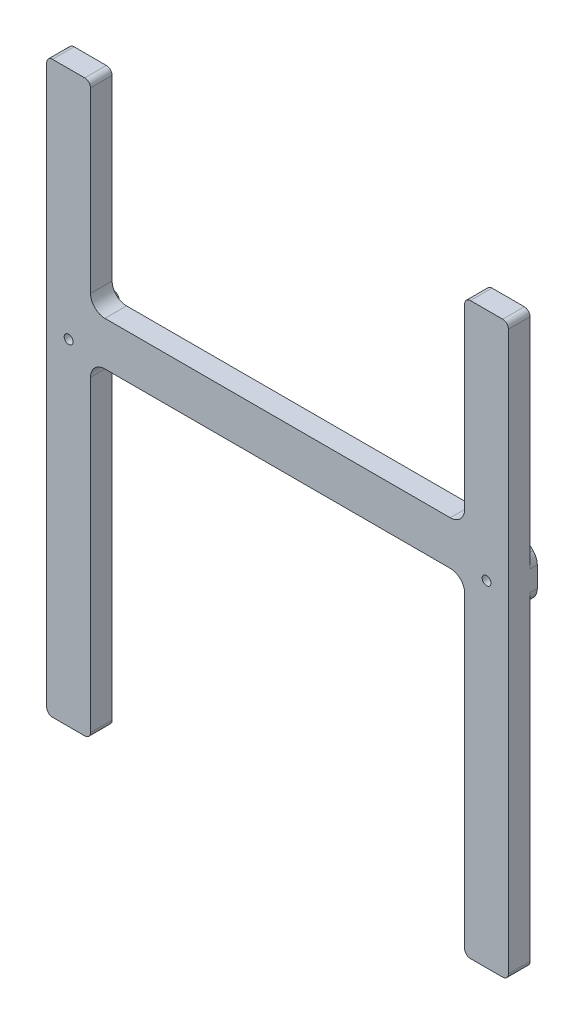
ISO-10303-21;
HEADER;
FILE_DESCRIPTION(('STEP AP214'),'2;1');
FILE_NAME('part.step','',(''),(''),'','','');
FILE_SCHEMA(('AUTOMOTIVE_DESIGN { 1 0 10303 214 1 1 1 1 }'));
ENDSEC;
DATA;
#1=APPLICATION_CONTEXT('core data for automotive mechanical design processes');
#2=APPLICATION_PROTOCOL_DEFINITION('international standard','automotive_design',2000,#1);
#3=PRODUCT_CONTEXT('',#1,'mechanical');
#4=PRODUCT('Part','Part','',(#3));
#5=PRODUCT_RELATED_PRODUCT_CATEGORY('part','',(#4));
#6=PRODUCT_DEFINITION_FORMATION('','',#4);
#7=PRODUCT_DEFINITION_CONTEXT('part definition',#1,'design');
#8=PRODUCT_DEFINITION('design','',#6,#7);
#9=PRODUCT_DEFINITION_SHAPE('','',#8);
#10=(LENGTH_UNIT() NAMED_UNIT(*) SI_UNIT(.MILLI.,.METRE.));
#11=(NAMED_UNIT(*) PLANE_ANGLE_UNIT() SI_UNIT($,.RADIAN.));
#12=(NAMED_UNIT(*) SI_UNIT($,.STERADIAN.) SOLID_ANGLE_UNIT());
#13=UNCERTAINTY_MEASURE_WITH_UNIT(LENGTH_MEASURE(1.E-05),#10,'distance_accuracy_value','');
#14=(GEOMETRIC_REPRESENTATION_CONTEXT(3) GLOBAL_UNCERTAINTY_ASSIGNED_CONTEXT((#13)) GLOBAL_UNIT_ASSIGNED_CONTEXT((#10,
#11,#12)) REPRESENTATION_CONTEXT('',''));
#15=CARTESIAN_POINT('',(0.,0.,0.));
#16=DIRECTION('',(0.,0.,1.));
#17=DIRECTION('',(1.,0.,0.));
#18=AXIS2_PLACEMENT_3D('',#15,#16,#17);
#19=CARTESIAN_POINT('',(92.8528612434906,6.477,-3.175));
#20=DIRECTION('',(0.,1.,0.));
#21=DIRECTION('',(0.,0.,1.));
#22=AXIS2_PLACEMENT_3D('',#19,#20,#21);
#23=PLANE('',#22);
#24=DIRECTION('',(1.,0.,0.));
#25=VECTOR('',#24,1.);
#26=CARTESIAN_POINT('',(92.8528612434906,6.477,0.));
#27=LINE('',#26,#25);
#28=CARTESIAN_POINT('',(-90.2226051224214,6.477,0.));
#29=VERTEX_POINT('',#28);
#30=CARTESIAN_POINT('',(-85.09,6.477,0.));
#31=VERTEX_POINT('',#30);
#32=EDGE_CURVE('E547',#29,#31,#27,.T.);
#33=ORIENTED_EDGE('',*,*,#32,.T.);
#34=DIRECTION('',(0.,0.,1.));
#35=VECTOR('',#34,1.);
#36=CARTESIAN_POINT('',(-85.09,6.477,-3.175));
#37=LINE('',#36,#35);
#38=CARTESIAN_POINT('',(-85.09,6.477,-3.175));
#39=VERTEX_POINT('',#38);
#40=EDGE_CURVE('E698',#31,#39,#37,.F.);
#41=ORIENTED_EDGE('',*,*,#40,.T.);
#42=DIRECTION('',(-1.,0.,0.));
#43=VECTOR('',#42,1.);
#44=CARTESIAN_POINT('',(92.8528612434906,6.477,-3.175));
#45=LINE('',#44,#43);
#46=CARTESIAN_POINT('',(-90.2226051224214,6.477,-3.175));
#47=VERTEX_POINT('',#46);
#48=EDGE_CURVE('E520',#39,#47,#45,.T.);
#49=ORIENTED_EDGE('',*,*,#48,.T.);
#50=DIRECTION('',(0.,0.,1.));
#51=VECTOR('',#50,1.);
#52=CARTESIAN_POINT('',(-90.2226051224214,6.477,-3.175));
#53=LINE('',#52,#51);
#54=EDGE_CURVE('E595',#47,#29,#53,.T.);
#55=ORIENTED_EDGE('',*,*,#54,.T.);
#56=EDGE_LOOP('',(#33,#41,#49,#55));
#57=FACE_BOUND('',#56,.T.);
#58=ADVANCED_FACE('F43',(#57),#23,.T.);
#59=CARTESIAN_POINT('',(90.2226051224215,6.477,-3.175));
#60=VERTEX_POINT('',#59);
#61=CARTESIAN_POINT('',(85.09,6.477,-3.175));
#62=VERTEX_POINT('',#61);
#63=EDGE_CURVE('E521',#60,#62,#45,.T.);
#64=ORIENTED_EDGE('',*,*,#63,.T.);
#65=DIRECTION('',(0.,0.,-1.));
#66=VECTOR('',#65,1.);
#67=CARTESIAN_POINT('',(85.09,6.477,0.));
#68=LINE('',#67,#66);
#69=CARTESIAN_POINT('',(85.09,6.477,0.));
#70=VERTEX_POINT('',#69);
#71=EDGE_CURVE('E732',#62,#70,#68,.F.);
#72=ORIENTED_EDGE('',*,*,#71,.T.);
#73=DIRECTION('',(1.,0.,0.));
#74=VECTOR('',#73,1.);
#75=CARTESIAN_POINT('',(92.8528612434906,6.477,0.));
#76=LINE('',#75,#74);
#77=CARTESIAN_POINT('',(90.2226051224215,6.477,0.));
#78=VERTEX_POINT('',#77);
#79=EDGE_CURVE('E545',#70,#78,#76,.T.);
#80=ORIENTED_EDGE('',*,*,#79,.T.);
#81=DIRECTION('',(0.,0.,1.));
#82=VECTOR('',#81,1.);
#83=CARTESIAN_POINT('',(90.2226051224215,6.477,-3.175));
#84=LINE('',#83,#82);
#85=EDGE_CURVE('E570',#78,#60,#84,.F.);
#86=ORIENTED_EDGE('',*,*,#85,.T.);
#87=EDGE_LOOP('',(#64,#72,#80,#86));
#88=FACE_BOUND('',#87,.T.);
#89=ADVANCED_FACE('F1119',(#88),#23,.T.);
#90=CARTESIAN_POINT('',(0.,0.,-3.175));
#91=DIRECTION('',(0.,0.,1.));
#92=DIRECTION('',(1.,0.,0.));
#93=AXIS2_PLACEMENT_3D('',#90,#91,#92);
#94=PLANE('',#93);
#95=ORIENTED_EDGE('',*,*,#48,.F.);
#96=CARTESIAN_POINT('',(-85.09,3.937,-3.175));
#97=DIRECTION('',(0.,0.,1.));
#98=DIRECTION('',(1.,0.,0.));
#99=AXIS2_PLACEMENT_3D('',#96,#97,#98);
#100=CIRCLE('',#99,2.54);
#101=CARTESIAN_POINT('',(-82.55,3.937,-3.175));
#102=VERTEX_POINT('',#101);
#103=EDGE_CURVE('E706',#39,#102,#100,.F.);
#104=ORIENTED_EDGE('',*,*,#103,.T.);
#105=DIRECTION('',(0.,-1.,0.));
#106=VECTOR('',#105,1.);
#107=CARTESIAN_POINT('',(-82.55,0.,-3.175));
#108=LINE('',#107,#106);
#109=CARTESIAN_POINT('',(-82.55,2.667,-3.175));
#110=VERTEX_POINT('',#109);
#111=EDGE_CURVE('E1039',#102,#110,#108,.T.);
#112=ORIENTED_EDGE('',*,*,#111,.T.);
#113=CARTESIAN_POINT('',(-85.09,2.667,-3.175));
#114=DIRECTION('',(0.,0.,1.));
#115=DIRECTION('',(1.,0.,0.));
#116=AXIS2_PLACEMENT_3D('',#113,#114,#115);
#117=CIRCLE('',#116,2.54);
#118=CARTESIAN_POINT('',(-85.09,0.127,-3.175));
#119=VERTEX_POINT('',#118);
#120=EDGE_CURVE('E704',#110,#119,#117,.F.);
#121=ORIENTED_EDGE('',*,*,#120,.T.);
#122=DIRECTION('',(-1.,0.,0.));
#123=VECTOR('',#122,1.);
#124=CARTESIAN_POINT('',(90.2226051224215,0.127,-3.175));
#125=LINE('',#124,#123);
#126=CARTESIAN_POINT('',(-90.2226051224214,0.127,-3.175));
#127=VERTEX_POINT('',#126);
#128=EDGE_CURVE('E917',#119,#127,#125,.T.);
#129=ORIENTED_EDGE('',*,*,#128,.T.);
#130=DIRECTION('',(-0.707106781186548,-0.707106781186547,0.));
#131=VECTOR('',#130,1.);
#132=CARTESIAN_POINT('',(-90.2226051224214,0.127,-3.175));
#133=LINE('',#132,#131);
#134=CARTESIAN_POINT('',(-95.377,-5.02739487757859,-3.175));
#135=VERTEX_POINT('',#134);
#136=EDGE_CURVE('E920',#127,#135,#133,.T.);
#137=ORIENTED_EDGE('',*,*,#136,.T.);
#138=DIRECTION('',(0.,-1.,0.));
#139=VECTOR('',#138,1.);
#140=CARTESIAN_POINT('',(-95.377,-5.02739487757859,-3.175));
#141=LINE('',#140,#139);
#142=CARTESIAN_POINT('',(-95.377,-14.0226051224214,-3.175));
#143=VERTEX_POINT('',#142);
#144=EDGE_CURVE('E923',#135,#143,#141,.T.);
#145=ORIENTED_EDGE('',*,*,#144,.T.);
#146=DIRECTION('',(0.707106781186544,-0.707106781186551,0.));
#147=VECTOR('',#146,1.);
#148=CARTESIAN_POINT('',(-95.377,-14.0226051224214,-3.175));
#149=LINE('',#148,#147);
#150=CARTESIAN_POINT('',(-90.2226051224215,-19.177,-3.175));
#151=VERTEX_POINT('',#150);
#152=EDGE_CURVE('E926',#143,#151,#149,.T.);
#153=ORIENTED_EDGE('',*,*,#152,.T.);
#154=DIRECTION('',(1.,0.,0.));
#155=VECTOR('',#154,1.);
#156=CARTESIAN_POINT('',(-90.2226051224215,-19.177,-3.175));
#157=LINE('',#156,#155);
#158=CARTESIAN_POINT('',(-88.773,-19.177,-3.175));
#159=VERTEX_POINT('',#158);
#160=EDGE_CURVE('E929',#151,#159,#157,.T.);
#161=ORIENTED_EDGE('',*,*,#160,.T.);
#162=DIRECTION('',(0.,1.,0.));
#163=VECTOR('',#162,1.);
#164=CARTESIAN_POINT('',(-88.773,-19.177,-3.175));
#165=LINE('',#164,#163);
#166=CARTESIAN_POINT('',(-88.773,-9.017,-3.175));
#167=VERTEX_POINT('',#166);
#168=EDGE_CURVE('E932',#159,#167,#165,.T.);
#169=ORIENTED_EDGE('',*,*,#168,.T.);
#170=CARTESIAN_POINT('',(-86.233,-9.017,-3.175));
#171=DIRECTION('',(0.,0.,1.));
#172=DIRECTION('',(1.,0.,0.));
#173=AXIS2_PLACEMENT_3D('',#170,#171,#172);
#174=CIRCLE('',#173,2.54);
#175=CARTESIAN_POINT('',(-86.233,-6.477,-3.175));
#176=VERTEX_POINT('',#175);
#177=EDGE_CURVE('E700',#167,#176,#174,.F.);
#178=ORIENTED_EDGE('',*,*,#177,.T.);
#179=DIRECTION('',(1.,0.,0.));
#180=VECTOR('',#179,1.);
#181=CARTESIAN_POINT('',(-88.773,-6.477,-3.175));
#182=LINE('',#181,#180);
#183=CARTESIAN_POINT('',(-85.09,-6.477,-3.175));
#184=VERTEX_POINT('',#183);
#185=EDGE_CURVE('E938',#176,#184,#182,.T.);
#186=ORIENTED_EDGE('',*,*,#185,.T.);
#187=CARTESIAN_POINT('',(-85.09,-9.017,-3.175));
#188=DIRECTION('',(0.,0.,1.));
#189=DIRECTION('',(1.,0.,0.));
#190=AXIS2_PLACEMENT_3D('',#187,#188,#189);
#191=CIRCLE('',#190,2.54);
#192=CARTESIAN_POINT('',(-82.55,-9.017,-3.175));
#193=VERTEX_POINT('',#192);
#194=EDGE_CURVE('E702',#184,#193,#191,.F.);
#195=ORIENTED_EDGE('',*,*,#194,.T.);
#196=CARTESIAN_POINT('',(-82.55,-20.4406340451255,-3.175));
#197=VERTEX_POINT('',#196);
#198=EDGE_CURVE('E1040',#193,#197,#108,.T.);
#199=ORIENTED_EDGE('',*,*,#198,.T.);
#200=CARTESIAN_POINT('',(-88.773,-19.177,-3.175));
#201=DIRECTION('',(0.,0.,1.));
#202=DIRECTION('',(1.,0.,0.));
#203=AXIS2_PLACEMENT_3D('',#200,#201,#202);
#204=CIRCLE('',#203,6.35);
#205=CARTESIAN_POINT('',(-88.773,-25.527,-3.175));
#206=VERTEX_POINT('',#205);
#207=EDGE_CURVE('E603',#197,#206,#204,.F.);
#208=ORIENTED_EDGE('',*,*,#207,.T.);
#209=DIRECTION('',(1.,0.,0.));
#210=VECTOR('',#209,1.);
#211=CARTESIAN_POINT('',(-92.8528612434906,-25.527,-3.175));
#212=LINE('',#211,#210);
#213=CARTESIAN_POINT('',(-90.2226051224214,-25.527,-3.175));
#214=VERTEX_POINT('',#213);
#215=EDGE_CURVE('E533',#214,#206,#212,.T.);
#216=ORIENTED_EDGE('',*,*,#215,.F.);
#217=CARTESIAN_POINT('',(-90.2226051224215,-19.177,-3.175));
#218=DIRECTION('',(0.,0.,1.));
#219=DIRECTION('',(1.,0.,0.));
#220=AXIS2_PLACEMENT_3D('',#217,#218,#219);
#221=CIRCLE('',#220,6.35);
#222=CARTESIAN_POINT('',(-94.7127331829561,-23.6671280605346,-3.175));
#223=VERTEX_POINT('',#222);
#224=EDGE_CURVE('E605',#214,#223,#221,.F.);
#225=ORIENTED_EDGE('',*,*,#224,.T.);
#226=DIRECTION('',(0.707106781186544,-0.707106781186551,0.));
#227=VECTOR('',#226,1.);
#228=CARTESIAN_POINT('',(-101.727,-16.6528612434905,-3.175));
#229=LINE('',#228,#227);
#230=CARTESIAN_POINT('',(-99.8671280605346,-18.512733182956,-3.175));
#231=VERTEX_POINT('',#230);
#232=EDGE_CURVE('E530',#231,#223,#229,.T.);
#233=ORIENTED_EDGE('',*,*,#232,.F.);
#234=CARTESIAN_POINT('',(-95.377,-14.0226051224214,-3.175));
#235=DIRECTION('',(0.,0.,1.));
#236=DIRECTION('',(1.,0.,0.));
#237=AXIS2_PLACEMENT_3D('',#234,#235,#236);
#238=CIRCLE('',#237,6.35);
#239=CARTESIAN_POINT('',(-101.727,-14.0226051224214,-3.175));
#240=VERTEX_POINT('',#239);
#241=EDGE_CURVE('E607',#231,#240,#238,.F.);
#242=ORIENTED_EDGE('',*,*,#241,.T.);
#243=DIRECTION('',(0.,-1.,0.));
#244=VECTOR('',#243,1.);
#245=CARTESIAN_POINT('',(-101.727,-2.39713875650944,-3.175));
#246=LINE('',#245,#244);
#247=CARTESIAN_POINT('',(-101.727,-5.0273948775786,-3.175));
#248=VERTEX_POINT('',#247);
#249=EDGE_CURVE('E527',#248,#240,#246,.T.);
#250=ORIENTED_EDGE('',*,*,#249,.F.);
#251=CARTESIAN_POINT('',(-95.377,-5.0273948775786,-3.175));
#252=DIRECTION('',(0.,0.,1.));
#253=DIRECTION('',(1.,0.,0.));
#254=AXIS2_PLACEMENT_3D('',#251,#252,#253);
#255=CIRCLE('',#254,6.35);
#256=CARTESIAN_POINT('',(-99.8671280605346,-0.537266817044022,-3.175));
#257=VERTEX_POINT('',#256);
#258=EDGE_CURVE('E609',#248,#257,#255,.F.);
#259=ORIENTED_EDGE('',*,*,#258,.T.);
#260=DIRECTION('',(-0.707106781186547,-0.707106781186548,0.));
#261=VECTOR('',#260,1.);
#262=CARTESIAN_POINT('',(-92.8528612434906,6.477,-3.175));
#263=LINE('',#262,#261);
#264=CARTESIAN_POINT('',(-94.712733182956,4.61712806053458,-3.175));
#265=VERTEX_POINT('',#264);
#266=EDGE_CURVE('E524',#265,#257,#263,.T.);
#267=ORIENTED_EDGE('',*,*,#266,.F.);
#268=CARTESIAN_POINT('',(-90.2226051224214,0.127,-3.175));
#269=DIRECTION('',(0.,0.,1.));
#270=DIRECTION('',(1.,0.,0.));
#271=AXIS2_PLACEMENT_3D('',#268,#269,#270);
#272=CIRCLE('',#271,6.35);
#273=EDGE_CURVE('E611',#265,#47,#272,.F.);
#274=ORIENTED_EDGE('',*,*,#273,.T.);
#275=EDGE_LOOP('',(#95,#104,#112,#121,#129,#137,#145,#153,#161,#169,#178,#186,#195,#199,#208,
#216,#225,#233,#242,#250,#259,#267,#274));
#276=FACE_BOUND('',#275,.T.);
#277=ADVANCED_FACE('F1007',(#276),#94,.F.);
#278=CARTESIAN_POINT('',(-88.773,-6.477,-3.175));
#279=DIRECTION('',(0.,-1.,0.));
#280=DIRECTION('',(0.,0.,-1.));
#281=AXIS2_PLACEMENT_3D('',#278,#279,#280);
#282=PLANE('',#281);
#283=DIRECTION('',(1.,0.,0.));
#284=VECTOR('',#283,1.);
#285=CARTESIAN_POINT('',(-88.773,-6.477,0.));
#286=LINE('',#285,#284);
#287=CARTESIAN_POINT('',(-86.233,-6.477,0.));
#288=VERTEX_POINT('',#287);
#289=CARTESIAN_POINT('',(-85.09,-6.477,0.));
#290=VERTEX_POINT('',#289);
#291=EDGE_CURVE('E963',#288,#290,#286,.T.);
#292=ORIENTED_EDGE('',*,*,#291,.T.);
#293=DIRECTION('',(0.,0.,-1.));
#294=VECTOR('',#293,1.);
#295=CARTESIAN_POINT('',(-85.09,-6.477,-3.175));
#296=LINE('',#295,#294);
#297=EDGE_CURVE('E714',#290,#184,#296,.T.);
#298=ORIENTED_EDGE('',*,*,#297,.T.);
#299=ORIENTED_EDGE('',*,*,#185,.F.);
#300=DIRECTION('',(0.,0.,1.));
#301=VECTOR('',#300,1.);
#302=CARTESIAN_POINT('',(-86.233,-6.477,-3.175));
#303=LINE('',#302,#301);
#304=EDGE_CURVE('E711',#176,#288,#303,.T.);
#305=ORIENTED_EDGE('',*,*,#304,.T.);
#306=EDGE_LOOP('',(#292,#298,#299,#305));
#307=FACE_BOUND('',#306,.T.);
#308=ADVANCED_FACE('F1492',(#307),#282,.F.);
#309=CARTESIAN_POINT('',(90.2226051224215,0.127,-3.175));
#310=DIRECTION('',(0.,1.,0.));
#311=DIRECTION('',(0.,0.,1.));
#312=AXIS2_PLACEMENT_3D('',#309,#310,#311);
#313=PLANE('',#312);
#314=ORIENTED_EDGE('',*,*,#128,.F.);
#315=DIRECTION('',(0.,0.,1.));
#316=VECTOR('',#315,1.);
#317=CARTESIAN_POINT('',(-85.09,0.127,-3.175));
#318=LINE('',#317,#316);
#319=CARTESIAN_POINT('',(-85.09,0.127,0.));
#320=VERTEX_POINT('',#319);
#321=EDGE_CURVE('E708',#119,#320,#318,.T.);
#322=ORIENTED_EDGE('',*,*,#321,.T.);
#323=DIRECTION('',(-1.,0.,0.));
#324=VECTOR('',#323,1.);
#325=CARTESIAN_POINT('',(90.2226051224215,0.127,0.));
#326=LINE('',#325,#324);
#327=CARTESIAN_POINT('',(-90.2226051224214,0.127,0.));
#328=VERTEX_POINT('',#327);
#329=EDGE_CURVE('E491',#320,#328,#326,.T.);
#330=ORIENTED_EDGE('',*,*,#329,.T.);
#331=DIRECTION('',(0.,0.,1.));
#332=VECTOR('',#331,1.);
#333=CARTESIAN_POINT('',(-90.2226051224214,0.127,-3.175));
#334=LINE('',#333,#332);
#335=EDGE_CURVE('E506',#127,#328,#334,.T.);
#336=ORIENTED_EDGE('',*,*,#335,.F.);
#337=EDGE_LOOP('',(#314,#322,#330,#336));
#338=FACE_BOUND('',#337,.T.);
#339=ADVANCED_FACE('F1010',(#338),#313,.F.);
#340=CARTESIAN_POINT('',(101.727,-2.39713875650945,-3.175));
#341=DIRECTION('',(0.707106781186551,0.707106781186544,0.));
#342=DIRECTION('',(-0.707106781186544,0.707106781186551,0.));
#343=AXIS2_PLACEMENT_3D('',#340,#341,#342);
#344=PLANE('',#343);
#345=DIRECTION('',(0.707106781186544,-0.707106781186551,0.));
#346=VECTOR('',#345,1.);
#347=CARTESIAN_POINT('',(101.727,-2.39713875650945,0.));
#348=LINE('',#347,#346);
#349=CARTESIAN_POINT('',(94.7127331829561,4.61712806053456,0.));
#350=VERTEX_POINT('',#349);
#351=CARTESIAN_POINT('',(99.8671280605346,-0.53726681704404,0.));
#352=VERTEX_POINT('',#351);
#353=EDGE_CURVE('E882',#350,#352,#348,.T.);
#354=ORIENTED_EDGE('',*,*,#353,.T.);
#355=DIRECTION('',(0.,0.,1.));
#356=VECTOR('',#355,1.);
#357=CARTESIAN_POINT('',(99.8671280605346,-0.53726681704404,-3.175));
#358=LINE('',#357,#356);
#359=CARTESIAN_POINT('',(99.8671280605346,-0.537266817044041,-3.175));
#360=VERTEX_POINT('',#359);
#361=EDGE_CURVE('E558',#352,#360,#358,.F.);
#362=ORIENTED_EDGE('',*,*,#361,.T.);
#363=DIRECTION('',(-0.707106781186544,0.707106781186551,0.));
#364=VECTOR('',#363,1.);
#365=CARTESIAN_POINT('',(101.727,-2.39713875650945,-3.175));
#366=LINE('',#365,#364);
#367=CARTESIAN_POINT('',(94.7127331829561,4.61712806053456,-3.175));
#368=VERTEX_POINT('',#367);
#369=EDGE_CURVE('E517',#360,#368,#366,.T.);
#370=ORIENTED_EDGE('',*,*,#369,.T.);
#371=DIRECTION('',(0.,0.,1.));
#372=VECTOR('',#371,1.);
#373=CARTESIAN_POINT('',(94.7127331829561,4.61712806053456,-3.175));
#374=LINE('',#373,#372);
#375=EDGE_CURVE('E555',#368,#350,#374,.T.);
#376=ORIENTED_EDGE('',*,*,#375,.T.);
#377=EDGE_LOOP('',(#354,#362,#370,#376));
#378=FACE_BOUND('',#377,.T.);
#379=ADVANCED_FACE('F1512',(#378),#344,.T.);
#380=CARTESIAN_POINT('',(92.8528612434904,-25.527,-3.175));
#381=DIRECTION('',(0.707106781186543,-0.707106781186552,0.));
#382=DIRECTION('',(0.707106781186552,0.707106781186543,0.));
#383=AXIS2_PLACEMENT_3D('',#380,#381,#382);
#384=PLANE('',#383);
#385=DIRECTION('',(-0.707106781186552,-0.707106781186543,0.));
#386=VECTOR('',#385,1.);
#387=CARTESIAN_POINT('',(92.8528612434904,-25.527,0.));
#388=LINE('',#387,#386);
#389=CARTESIAN_POINT('',(99.8671280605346,-18.512733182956,0.));
#390=VERTEX_POINT('',#389);
#391=CARTESIAN_POINT('',(94.7127331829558,-23.6671280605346,0.));
#392=VERTEX_POINT('',#391);
#393=EDGE_CURVE('E889',#390,#392,#388,.T.);
#394=ORIENTED_EDGE('',*,*,#393,.T.);
#395=DIRECTION('',(0.,0.,1.));
#396=VECTOR('',#395,1.);
#397=CARTESIAN_POINT('',(94.7127331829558,-23.6671280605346,-3.175));
#398=LINE('',#397,#396);
#399=CARTESIAN_POINT('',(94.7127331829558,-23.6671280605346,-3.175));
#400=VERTEX_POINT('',#399);
#401=EDGE_CURVE('E593',#392,#400,#398,.F.);
#402=ORIENTED_EDGE('',*,*,#401,.T.);
#403=DIRECTION('',(0.707106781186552,0.707106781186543,0.));
#404=VECTOR('',#403,1.);
#405=CARTESIAN_POINT('',(92.8528612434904,-25.527,-3.175));
#406=LINE('',#405,#404);
#407=CARTESIAN_POINT('',(99.8671280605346,-18.512733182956,-3.175));
#408=VERTEX_POINT('',#407);
#409=EDGE_CURVE('E539',#400,#408,#406,.T.);
#410=ORIENTED_EDGE('',*,*,#409,.T.);
#411=DIRECTION('',(0.,0.,1.));
#412=VECTOR('',#411,1.);
#413=CARTESIAN_POINT('',(99.8671280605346,-18.512733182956,-3.175));
#414=LINE('',#413,#412);
#415=EDGE_CURVE('E590',#408,#390,#414,.T.);
#416=ORIENTED_EDGE('',*,*,#415,.T.);
#417=EDGE_LOOP('',(#394,#402,#410,#416));
#418=FACE_BOUND('',#417,.T.);
#419=ADVANCED_FACE('F1584',(#418),#384,.T.);
#420=CARTESIAN_POINT('',(82.423,-25.527,-3.175));
#421=DIRECTION('',(0.,-1.,0.));
#422=DIRECTION('',(0.,0.,-1.));
#423=AXIS2_PLACEMENT_3D('',#420,#421,#422);
#424=PLANE('',#423);
#425=DIRECTION('',(-1.,0.,0.));
#426=VECTOR('',#425,1.);
#427=CARTESIAN_POINT('',(82.423,-25.527,0.));
#428=LINE('',#427,#426);
#429=CARTESIAN_POINT('',(90.2226051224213,-25.527,0.));
#430=VERTEX_POINT('',#429);
#431=CARTESIAN_POINT('',(88.773,-25.527,0.));
#432=VERTEX_POINT('',#431);
#433=EDGE_CURVE('E885',#430,#432,#428,.T.);
#434=ORIENTED_EDGE('',*,*,#433,.T.);
#435=DIRECTION('',(0.,0.,1.));
#436=VECTOR('',#435,1.);
#437=CARTESIAN_POINT('',(88.773,-25.527,-3.175));
#438=LINE('',#437,#436);
#439=CARTESIAN_POINT('',(88.773,-25.527,-3.175));
#440=VERTEX_POINT('',#439);
#441=EDGE_CURVE('E578',#432,#440,#438,.F.);
#442=ORIENTED_EDGE('',*,*,#441,.T.);
#443=DIRECTION('',(1.,0.,0.));
#444=VECTOR('',#443,1.);
#445=CARTESIAN_POINT('',(82.423,-25.527,-3.175));
#446=LINE('',#445,#444);
#447=CARTESIAN_POINT('',(90.2226051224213,-25.527,-3.175));
#448=VERTEX_POINT('',#447);
#449=EDGE_CURVE('E536',#440,#448,#446,.T.);
#450=ORIENTED_EDGE('',*,*,#449,.T.);
#451=DIRECTION('',(0.,0.,1.));
#452=VECTOR('',#451,1.);
#453=CARTESIAN_POINT('',(90.2226051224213,-25.527,-3.175));
#454=LINE('',#453,#452);
#455=EDGE_CURVE('E575',#448,#430,#454,.T.);
#456=ORIENTED_EDGE('',*,*,#455,.T.);
#457=EDGE_LOOP('',(#434,#442,#450,#456));
#458=FACE_BOUND('',#457,.T.);
#459=ADVANCED_FACE('F1596',(#458),#424,.T.);
#460=CARTESIAN_POINT('',(-92.8528612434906,-25.527,-3.175));
#461=DIRECTION('',(0.,-1.,0.));
#462=DIRECTION('',(1.,0.,0.));
#463=AXIS2_PLACEMENT_3D('',#460,#461,#462);
#464=PLANE('',#463);
#465=DIRECTION('',(-1.,0.,0.));
#466=VECTOR('',#465,1.);
#467=CARTESIAN_POINT('',(-92.8528612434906,-25.527,0.));
#468=LINE('',#467,#466);
#469=CARTESIAN_POINT('',(-88.773,-25.527,0.));
#470=VERTEX_POINT('',#469);
#471=CARTESIAN_POINT('',(-90.2226051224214,-25.527,0.));
#472=VERTEX_POINT('',#471);
#473=EDGE_CURVE('E898',#470,#472,#468,.T.);
#474=ORIENTED_EDGE('',*,*,#473,.T.);
#475=DIRECTION('',(0.,0.,1.));
#476=VECTOR('',#475,1.);
#477=CARTESIAN_POINT('',(-90.2226051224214,-25.527,-3.175));
#478=LINE('',#477,#476);
#479=EDGE_CURVE('E627',#472,#214,#478,.F.);
#480=ORIENTED_EDGE('',*,*,#479,.T.);
#481=ORIENTED_EDGE('',*,*,#215,.T.);
#482=DIRECTION('',(0.,0.,1.));
#483=VECTOR('',#482,1.);
#484=CARTESIAN_POINT('',(-88.773,-25.527,-3.175));
#485=LINE('',#484,#483);
#486=EDGE_CURVE('E624',#206,#470,#485,.T.);
#487=ORIENTED_EDGE('',*,*,#486,.T.);
#488=EDGE_LOOP('',(#474,#480,#481,#487));
#489=FACE_BOUND('',#488,.T.);
#490=ADVANCED_FACE('F1607',(#489),#464,.T.);
#491=CARTESIAN_POINT('',(-101.727,-16.6528612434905,-3.175));
#492=DIRECTION('',(-0.707106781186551,-0.707106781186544,0.));
#493=DIRECTION('',(0.707106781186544,-0.707106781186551,0.));
#494=AXIS2_PLACEMENT_3D('',#491,#492,#493);
#495=PLANE('',#494);
#496=DIRECTION('',(-0.707106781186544,0.707106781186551,0.));
#497=VECTOR('',#496,1.);
#498=CARTESIAN_POINT('',(-101.727,-16.6528612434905,0.));
#499=LINE('',#498,#497);
#500=CARTESIAN_POINT('',(-94.7127331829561,-23.6671280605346,0.));
#501=VERTEX_POINT('',#500);
#502=CARTESIAN_POINT('',(-99.8671280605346,-18.512733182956,0.));
#503=VERTEX_POINT('',#502);
#504=EDGE_CURVE('E895',#501,#503,#499,.T.);
#505=ORIENTED_EDGE('',*,*,#504,.T.);
#506=DIRECTION('',(0.,0.,1.));
#507=VECTOR('',#506,1.);
#508=CARTESIAN_POINT('',(-99.8671280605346,-18.512733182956,-3.175));
#509=LINE('',#508,#507);
#510=EDGE_CURVE('E622',#503,#231,#509,.F.);
#511=ORIENTED_EDGE('',*,*,#510,.T.);
#512=ORIENTED_EDGE('',*,*,#232,.T.);
#513=DIRECTION('',(0.,0.,1.));
#514=VECTOR('',#513,1.);
#515=CARTESIAN_POINT('',(-94.7127331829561,-23.6671280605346,-3.175));
#516=LINE('',#515,#514);
#517=EDGE_CURVE('E619',#223,#501,#516,.T.);
#518=ORIENTED_EDGE('',*,*,#517,.T.);
#519=EDGE_LOOP('',(#505,#511,#512,#518));
#520=FACE_BOUND('',#519,.T.);
#521=ADVANCED_FACE('F1139',(#520),#495,.T.);
#522=CARTESIAN_POINT('',(-92.8528612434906,6.477,-3.175));
#523=DIRECTION('',(-0.707106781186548,0.707106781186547,0.));
#524=DIRECTION('',(-0.707106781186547,-0.707106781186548,0.));
#525=AXIS2_PLACEMENT_3D('',#522,#523,#524);
#526=PLANE('',#525);
#527=DIRECTION('',(0.707106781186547,0.707106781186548,0.));
#528=VECTOR('',#527,1.);
#529=CARTESIAN_POINT('',(-92.8528612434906,6.477,0.));
#530=LINE('',#529,#528);
#531=CARTESIAN_POINT('',(-99.8671280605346,-0.537266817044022,0.));
#532=VERTEX_POINT('',#531);
#533=CARTESIAN_POINT('',(-94.712733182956,4.61712806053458,0.));
#534=VERTEX_POINT('',#533);
#535=EDGE_CURVE('E892',#532,#534,#530,.T.);
#536=ORIENTED_EDGE('',*,*,#535,.T.);
#537=DIRECTION('',(0.,0.,1.));
#538=VECTOR('',#537,1.);
#539=CARTESIAN_POINT('',(-94.712733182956,4.61712806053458,-3.175));
#540=LINE('',#539,#538);
#541=EDGE_CURVE('E601',#534,#265,#540,.F.);
#542=ORIENTED_EDGE('',*,*,#541,.T.);
#543=ORIENTED_EDGE('',*,*,#266,.T.);
#544=DIRECTION('',(0.,0.,1.));
#545=VECTOR('',#544,1.);
#546=CARTESIAN_POINT('',(-99.8671280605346,-0.537266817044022,-3.175));
#547=LINE('',#546,#545);
#548=EDGE_CURVE('E598',#257,#532,#547,.T.);
#549=ORIENTED_EDGE('',*,*,#548,.T.);
#550=EDGE_LOOP('',(#536,#542,#543,#549));
#551=FACE_BOUND('',#550,.T.);
#552=ADVANCED_FACE('F1131',(#551),#526,.T.);
#553=DIRECTION('',(1.,0.,0.));
#554=VECTOR('',#553,1.);
#555=CARTESIAN_POINT('',(92.8528612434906,6.477,0.));
#556=LINE('',#555,#554);
#557=CARTESIAN_POINT('',(-76.073,6.477,0.));
#558=VERTEX_POINT('',#557);
#559=CARTESIAN_POINT('',(76.0730000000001,6.477,0.));
#560=VERTEX_POINT('',#559);
#561=EDGE_CURVE('E1033',#558,#560,#556,.T.);
#562=ORIENTED_EDGE('',*,*,#561,.F.);
#563=DIRECTION('',(0.,0.,1.));
#564=VECTOR('',#563,1.);
#565=CARTESIAN_POINT('',(-76.073,6.477,-3.175));
#566=LINE('',#565,#564);
#567=CARTESIAN_POINT('',(-76.073,6.477,9.525));
#568=VERTEX_POINT('',#567);
#569=EDGE_CURVE('E638',#558,#568,#566,.T.);
#570=ORIENTED_EDGE('',*,*,#569,.T.);
#571=DIRECTION('',(-1.,0.,0.));
#572=VECTOR('',#571,1.);
#573=CARTESIAN_POINT('',(92.8528612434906,6.477,9.525));
#574=LINE('',#573,#572);
#575=CARTESIAN_POINT('',(76.0730000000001,6.477,9.525));
#576=VERTEX_POINT('',#575);
#577=EDGE_CURVE('E901',#576,#568,#574,.T.);
#578=ORIENTED_EDGE('',*,*,#577,.F.);
#579=DIRECTION('',(0.,0.,-1.));
#580=VECTOR('',#579,1.);
#581=CARTESIAN_POINT('',(76.0730000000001,6.477,-3.175));
#582=LINE('',#581,#580);
#583=EDGE_CURVE('E635',#576,#560,#582,.T.);
#584=ORIENTED_EDGE('',*,*,#583,.T.);
#585=EDGE_LOOP('',(#562,#570,#578,#584));
#586=FACE_BOUND('',#585,.T.);
#587=ADVANCED_FACE('F1122',(#586),#23,.T.);
#588=CARTESIAN_POINT('',(101.727,-16.6528612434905,-3.175));
#589=DIRECTION('',(1.,0.,0.));
#590=DIRECTION('',(0.,0.,-1.));
#591=AXIS2_PLACEMENT_3D('',#588,#589,#590);
#592=PLANE('',#591);
#593=DIRECTION('',(0.,1.,0.));
#594=VECTOR('',#593,1.);
#595=CARTESIAN_POINT('',(101.727,93.7895,0.));
#596=LINE('',#595,#594);
#597=CARTESIAN_POINT('',(101.727,-5.0273948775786,0.));
#598=VERTEX_POINT('',#597);
#599=CARTESIAN_POINT('',(101.727,91.2495,0.));
#600=VERTEX_POINT('',#599);
#601=EDGE_CURVE('E867',#598,#600,#596,.T.);
#602=ORIENTED_EDGE('',*,*,#601,.T.);
#603=DIRECTION('',(0.,0.,-1.));
#604=VECTOR('',#603,1.);
#605=CARTESIAN_POINT('',(101.727,91.2495,9.525));
#606=LINE('',#605,#604);
#607=CARTESIAN_POINT('',(101.727,91.2495,9.525));
#608=VERTEX_POINT('',#607);
#609=EDGE_CURVE('E820',#600,#608,#606,.F.);
#610=ORIENTED_EDGE('',*,*,#609,.T.);
#611=DIRECTION('',(0.,1.,0.));
#612=VECTOR('',#611,1.);
#613=CARTESIAN_POINT('',(101.727,-16.6528612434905,9.525));
#614=LINE('',#613,#612);
#615=CARTESIAN_POINT('',(101.727,-154.7495,9.525));
#616=VERTEX_POINT('',#615);
#617=EDGE_CURVE('E500',#616,#608,#614,.T.);
#618=ORIENTED_EDGE('',*,*,#617,.F.);
#619=DIRECTION('',(0.,0.,-1.));
#620=VECTOR('',#619,1.);
#621=CARTESIAN_POINT('',(101.727,-154.7495,0.));
#622=LINE('',#621,#620);
#623=CARTESIAN_POINT('',(101.727,-154.7495,0.));
#624=VERTEX_POINT('',#623);
#625=EDGE_CURVE('E817',#616,#624,#622,.T.);
#626=ORIENTED_EDGE('',*,*,#625,.T.);
#627=CARTESIAN_POINT('',(101.727,-14.0226051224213,0.));
#628=VERTEX_POINT('',#627);
#629=EDGE_CURVE('E863',#624,#628,#596,.T.);
#630=ORIENTED_EDGE('',*,*,#629,.T.);
#631=DIRECTION('',(0.,0.,1.));
#632=VECTOR('',#631,1.);
#633=CARTESIAN_POINT('',(101.727,-14.0226051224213,-3.175));
#634=LINE('',#633,#632);
#635=CARTESIAN_POINT('',(101.727,-14.0226051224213,-3.175));
#636=VERTEX_POINT('',#635);
#637=EDGE_CURVE('E550',#628,#636,#634,.F.);
#638=ORIENTED_EDGE('',*,*,#637,.T.);
#639=DIRECTION('',(0.,1.,0.));
#640=VECTOR('',#639,1.);
#641=CARTESIAN_POINT('',(101.727,-16.6528612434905,-3.175));
#642=LINE('',#641,#640);
#643=CARTESIAN_POINT('',(101.727,-5.02739487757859,-3.175));
#644=VERTEX_POINT('',#643);
#645=EDGE_CURVE('E542',#636,#644,#642,.T.);
#646=ORIENTED_EDGE('',*,*,#645,.T.);
#647=DIRECTION('',(0.,0.,1.));
#648=VECTOR('',#647,1.);
#649=CARTESIAN_POINT('',(101.727,-5.02739487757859,-3.175));
#650=LINE('',#649,#648);
#651=EDGE_CURVE('E552',#644,#598,#650,.T.);
#652=ORIENTED_EDGE('',*,*,#651,.T.);
#653=EDGE_LOOP('',(#602,#610,#618,#626,#630,#638,#646,#652));
#654=FACE_BOUND('',#653,.T.);
#655=ADVANCED_FACE('F862',(#654),#592,.T.);
#656=CARTESIAN_POINT('',(82.423,-12.827,-3.175));
#657=DIRECTION('',(-1.,0.,0.));
#658=DIRECTION('',(0.,0.,1.));
#659=AXIS2_PLACEMENT_3D('',#656,#657,#658);
#660=PLANE('',#659);
#661=DIRECTION('',(0.,-1.,0.));
#662=VECTOR('',#661,1.);
#663=CARTESIAN_POINT('',(82.423,93.7895,0.));
#664=LINE('',#663,#662);
#665=CARTESIAN_POINT('',(82.423,-19.177,0.));
#666=VERTEX_POINT('',#665);
#667=CARTESIAN_POINT('',(82.423,-154.7495,0.));
#668=VERTEX_POINT('',#667);
#669=EDGE_CURVE('E869',#666,#668,#664,.T.);
#670=ORIENTED_EDGE('',*,*,#669,.T.);
#671=DIRECTION('',(0.,0.,-1.));
#672=VECTOR('',#671,1.);
#673=CARTESIAN_POINT('',(82.423,-154.7495,9.525));
#674=LINE('',#673,#672);
#675=CARTESIAN_POINT('',(82.423,-154.7495,9.525));
#676=VERTEX_POINT('',#675);
#677=EDGE_CURVE('E11',#668,#676,#674,.F.);
#678=ORIENTED_EDGE('',*,*,#677,.T.);
#679=DIRECTION('',(0.,-1.,0.));
#680=VECTOR('',#679,1.);
#681=CARTESIAN_POINT('',(82.423,-12.827,9.525));
#682=LINE('',#681,#680);
#683=CARTESIAN_POINT('',(82.423,-19.177,9.525));
#684=VERTEX_POINT('',#683);
#685=EDGE_CURVE('E912',#684,#676,#682,.T.);
#686=ORIENTED_EDGE('',*,*,#685,.F.);
#687=DIRECTION('',(0.,0.,1.));
#688=VECTOR('',#687,1.);
#689=CARTESIAN_POINT('',(82.423,-19.177,0.));
#690=LINE('',#689,#688);
#691=EDGE_CURVE('E572',#684,#666,#690,.F.);
#692=ORIENTED_EDGE('',*,*,#691,.T.);
#693=EDGE_LOOP('',(#670,#678,#686,#692));
#694=FACE_BOUND('',#693,.T.);
#695=ADVANCED_FACE('F1111',(#694),#660,.T.);
#696=CARTESIAN_POINT('',(-82.423,-12.827,-3.175));
#697=DIRECTION('',(0.,-1.,0.));
#698=DIRECTION('',(0.,0.,-1.));
#699=AXIS2_PLACEMENT_3D('',#696,#697,#698);
#700=PLANE('',#699);
#701=DIRECTION('',(1.,0.,0.));
#702=VECTOR('',#701,1.);
#703=CARTESIAN_POINT('',(-82.423,-12.827,9.525));
#704=LINE('',#703,#702);
#705=CARTESIAN_POINT('',(-76.073,-12.827,9.525));
#706=VERTEX_POINT('',#705);
#707=CARTESIAN_POINT('',(76.073,-12.827,9.525));
#708=VERTEX_POINT('',#707);
#709=EDGE_CURVE('E909',#706,#708,#704,.T.);
#710=ORIENTED_EDGE('',*,*,#709,.F.);
#711=DIRECTION('',(0.,0.,1.));
#712=VECTOR('',#711,1.);
#713=CARTESIAN_POINT('',(-76.073,-12.827,0.));
#714=LINE('',#713,#712);
#715=CARTESIAN_POINT('',(-76.073,-12.827,0.));
#716=VERTEX_POINT('',#715);
#717=EDGE_CURVE('E646',#706,#716,#714,.F.);
#718=ORIENTED_EDGE('',*,*,#717,.T.);
#719=DIRECTION('',(-1.,0.,0.));
#720=VECTOR('',#719,1.);
#721=CARTESIAN_POINT('',(-82.423,-12.827,0.));
#722=LINE('',#721,#720);
#723=CARTESIAN_POINT('',(76.073,-12.827,0.));
#724=VERTEX_POINT('',#723);
#725=EDGE_CURVE('E1036',#724,#716,#722,.T.);
#726=ORIENTED_EDGE('',*,*,#725,.F.);
#727=DIRECTION('',(0.,0.,1.));
#728=VECTOR('',#727,1.);
#729=CARTESIAN_POINT('',(76.073,-12.827,9.525));
#730=LINE('',#729,#728);
#731=EDGE_CURVE('E643',#724,#708,#730,.T.);
#732=ORIENTED_EDGE('',*,*,#731,.T.);
#733=EDGE_LOOP('',(#710,#718,#726,#732));
#734=FACE_BOUND('',#733,.T.);
#735=ADVANCED_FACE('F1102',(#734),#700,.T.);
#736=CARTESIAN_POINT('',(-82.423,-25.527,-3.175));
#737=DIRECTION('',(1.,0.,0.));
#738=DIRECTION('',(0.,0.,-1.));
#739=AXIS2_PLACEMENT_3D('',#736,#737,#738);
#740=PLANE('',#739);
#741=DIRECTION('',(0.,1.,0.));
#742=VECTOR('',#741,1.);
#743=CARTESIAN_POINT('',(-82.423,-25.527,9.525));
#744=LINE('',#743,#742);
#745=CARTESIAN_POINT('',(-82.423,-154.7495,9.525));
#746=VERTEX_POINT('',#745);
#747=CARTESIAN_POINT('',(-82.423,-19.177,9.525));
#748=VERTEX_POINT('',#747);
#749=EDGE_CURVE('E907',#746,#748,#744,.T.);
#750=ORIENTED_EDGE('',*,*,#749,.F.);
#751=DIRECTION('',(0.,0.,-1.));
#752=VECTOR('',#751,1.);
#753=CARTESIAN_POINT('',(-82.423,-154.7495,0.));
#754=LINE('',#753,#752);
#755=CARTESIAN_POINT('',(-82.423,-154.7495,0.));
#756=VERTEX_POINT('',#755);
#757=EDGE_CURVE('E831',#746,#756,#754,.T.);
#758=ORIENTED_EDGE('',*,*,#757,.T.);
#759=DIRECTION('',(0.,1.,0.));
#760=VECTOR('',#759,1.);
#761=CARTESIAN_POINT('',(-82.423,93.7895,0.));
#762=LINE('',#761,#760);
#763=CARTESIAN_POINT('',(-82.423,-19.177,0.));
#764=VERTEX_POINT('',#763);
#765=EDGE_CURVE('E1059',#756,#764,#762,.T.);
#766=ORIENTED_EDGE('',*,*,#765,.T.);
#767=DIRECTION('',(0.,0.,1.));
#768=VECTOR('',#767,1.);
#769=CARTESIAN_POINT('',(-82.423,-19.177,9.525));
#770=LINE('',#769,#768);
#771=EDGE_CURVE('E629',#764,#748,#770,.T.);
#772=ORIENTED_EDGE('',*,*,#771,.T.);
#773=EDGE_LOOP('',(#750,#758,#766,#772));
#774=FACE_BOUND('',#773,.T.);
#775=ADVANCED_FACE('F1092',(#774),#740,.T.);
#776=CARTESIAN_POINT('',(-101.727,-2.39713875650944,-3.175));
#777=DIRECTION('',(-1.,0.,0.));
#778=DIRECTION('',(0.,0.,1.));
#779=AXIS2_PLACEMENT_3D('',#776,#777,#778);
#780=PLANE('',#779);
#781=DIRECTION('',(0.,-1.,0.));
#782=VECTOR('',#781,1.);
#783=CARTESIAN_POINT('',(-101.727,-2.39713875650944,9.525));
#784=LINE('',#783,#782);
#785=CARTESIAN_POINT('',(-101.727,91.2495,9.525));
#786=VERTEX_POINT('',#785);
#787=CARTESIAN_POINT('',(-101.727,-154.7495,9.525));
#788=VERTEX_POINT('',#787);
#789=EDGE_CURVE('E904',#786,#788,#784,.T.);
#790=ORIENTED_EDGE('',*,*,#789,.F.);
#791=DIRECTION('',(0.,0.,-1.));
#792=VECTOR('',#791,1.);
#793=CARTESIAN_POINT('',(-101.727,91.2495,0.));
#794=LINE('',#793,#792);
#795=CARTESIAN_POINT('',(-101.727,91.2495,0.));
#796=VERTEX_POINT('',#795);
#797=EDGE_CURVE('E775',#786,#796,#794,.T.);
#798=ORIENTED_EDGE('',*,*,#797,.T.);
#799=DIRECTION('',(0.,-1.,0.));
#800=VECTOR('',#799,1.);
#801=CARTESIAN_POINT('',(-101.727,93.7895,0.));
#802=LINE('',#801,#800);
#803=CARTESIAN_POINT('',(-101.727,-5.0273948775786,0.));
#804=VERTEX_POINT('',#803);
#805=EDGE_CURVE('E1053',#796,#804,#802,.T.);
#806=ORIENTED_EDGE('',*,*,#805,.T.);
#807=DIRECTION('',(0.,0.,1.));
#808=VECTOR('',#807,1.);
#809=CARTESIAN_POINT('',(-101.727,-5.0273948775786,-3.175));
#810=LINE('',#809,#808);
#811=EDGE_CURVE('E617',#804,#248,#810,.F.);
#812=ORIENTED_EDGE('',*,*,#811,.T.);
#813=ORIENTED_EDGE('',*,*,#249,.T.);
#814=DIRECTION('',(0.,0.,1.));
#815=VECTOR('',#814,1.);
#816=CARTESIAN_POINT('',(-101.727,-14.0226051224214,-3.175));
#817=LINE('',#816,#815);
#818=CARTESIAN_POINT('',(-101.727,-14.0226051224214,0.));
#819=VERTEX_POINT('',#818);
#820=EDGE_CURVE('E614',#240,#819,#817,.T.);
#821=ORIENTED_EDGE('',*,*,#820,.T.);
#822=CARTESIAN_POINT('',(-101.727,-154.7495,0.));
#823=VERTEX_POINT('',#822);
#824=EDGE_CURVE('E877',#819,#823,#802,.T.);
#825=ORIENTED_EDGE('',*,*,#824,.T.);
#826=DIRECTION('',(0.,0.,-1.));
#827=VECTOR('',#826,1.);
#828=CARTESIAN_POINT('',(-101.727,-154.7495,9.525));
#829=LINE('',#828,#827);
#830=EDGE_CURVE('E763',#823,#788,#829,.F.);
#831=ORIENTED_EDGE('',*,*,#830,.T.);
#832=EDGE_LOOP('',(#790,#798,#806,#812,#813,#821,#825,#831));
#833=FACE_BOUND('',#832,.T.);
#834=ADVANCED_FACE('F1074',(#833),#780,.T.);
#835=DIRECTION('',(0.,1.,0.));
#836=VECTOR('',#835,1.);
#837=CARTESIAN_POINT('',(82.55,0.,-3.175));
#838=LINE('',#837,#836);
#839=CARTESIAN_POINT('',(82.55,2.667,-3.175));
#840=VERTEX_POINT('',#839);
#841=CARTESIAN_POINT('',(82.55,3.937,-3.175));
#842=VERTEX_POINT('',#841);
#843=EDGE_CURVE('E1042',#840,#842,#838,.T.);
#844=ORIENTED_EDGE('',*,*,#843,.T.);
#845=CARTESIAN_POINT('',(85.09,3.937,-3.175));
#846=DIRECTION('',(0.,0.,1.));
#847=DIRECTION('',(1.,0.,0.));
#848=AXIS2_PLACEMENT_3D('',#845,#846,#847);
#849=CIRCLE('',#848,2.54);
#850=EDGE_CURVE('E730',#842,#62,#849,.F.);
#851=ORIENTED_EDGE('',*,*,#850,.T.);
#852=ORIENTED_EDGE('',*,*,#63,.F.);
#853=CARTESIAN_POINT('',(90.2226051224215,0.127,-3.175));
#854=DIRECTION('',(0.,0.,1.));
#855=DIRECTION('',(1.,0.,0.));
#856=AXIS2_PLACEMENT_3D('',#853,#854,#855);
#857=CIRCLE('',#856,6.35);
#858=EDGE_CURVE('E566',#60,#368,#857,.F.);
#859=ORIENTED_EDGE('',*,*,#858,.T.);
#860=ORIENTED_EDGE('',*,*,#369,.F.);
#861=CARTESIAN_POINT('',(95.377,-5.02739487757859,-3.175));
#862=DIRECTION('',(0.,0.,1.));
#863=DIRECTION('',(1.,0.,0.));
#864=AXIS2_PLACEMENT_3D('',#861,#862,#863);
#865=CIRCLE('',#864,6.35);
#866=EDGE_CURVE('E568',#360,#644,#865,.F.);
#867=ORIENTED_EDGE('',*,*,#866,.T.);
#868=ORIENTED_EDGE('',*,*,#645,.F.);
#869=CARTESIAN_POINT('',(95.377,-14.0226051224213,-3.175));
#870=DIRECTION('',(0.,0.,1.));
#871=DIRECTION('',(1.,0.,0.));
#872=AXIS2_PLACEMENT_3D('',#869,#870,#871);
#873=CIRCLE('',#872,6.35);
#874=EDGE_CURVE('E560',#636,#408,#873,.F.);
#875=ORIENTED_EDGE('',*,*,#874,.T.);
#876=ORIENTED_EDGE('',*,*,#409,.F.);
#877=CARTESIAN_POINT('',(90.2226051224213,-19.177,-3.175));
#878=DIRECTION('',(0.,0.,1.));
#879=DIRECTION('',(1.,0.,0.));
#880=AXIS2_PLACEMENT_3D('',#877,#878,#879);
#881=CIRCLE('',#880,6.35);
#882=EDGE_CURVE('E562',#400,#448,#881,.F.);
#883=ORIENTED_EDGE('',*,*,#882,.T.);
#884=ORIENTED_EDGE('',*,*,#449,.F.);
#885=CARTESIAN_POINT('',(88.773,-19.177,-3.175));
#886=DIRECTION('',(0.,0.,1.));
#887=DIRECTION('',(1.,0.,0.));
#888=AXIS2_PLACEMENT_3D('',#885,#886,#887);
#889=CIRCLE('',#888,6.35);
#890=CARTESIAN_POINT('',(82.55,-20.4406340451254,-3.175));
#891=VERTEX_POINT('',#890);
#892=EDGE_CURVE('E564',#440,#891,#889,.F.);
#893=ORIENTED_EDGE('',*,*,#892,.T.);
#894=CARTESIAN_POINT('',(82.55,-9.017,-3.175));
#895=VERTEX_POINT('',#894);
#896=EDGE_CURVE('E879',#891,#895,#838,.T.);
#897=ORIENTED_EDGE('',*,*,#896,.T.);
#898=CARTESIAN_POINT('',(85.09,-9.017,-3.175));
#899=DIRECTION('',(0.,0.,1.));
#900=DIRECTION('',(1.,0.,0.));
#901=AXIS2_PLACEMENT_3D('',#898,#899,#900);
#902=CIRCLE('',#901,2.54);
#903=CARTESIAN_POINT('',(85.09,-6.477,-3.175));
#904=VERTEX_POINT('',#903);
#905=EDGE_CURVE('E726',#895,#904,#902,.F.);
#906=ORIENTED_EDGE('',*,*,#905,.T.);
#907=CARTESIAN_POINT('',(86.233,-6.477,-3.175));
#908=VERTEX_POINT('',#907);
#909=EDGE_CURVE('E935',#904,#908,#182,.T.);
#910=ORIENTED_EDGE('',*,*,#909,.T.);
#911=CARTESIAN_POINT('',(86.233,-9.017,-3.175));
#912=DIRECTION('',(0.,0.,1.));
#913=DIRECTION('',(1.,0.,0.));
#914=AXIS2_PLACEMENT_3D('',#911,#912,#913);
#915=CIRCLE('',#914,2.54);
#916=CARTESIAN_POINT('',(88.773,-9.017,-3.175));
#917=VERTEX_POINT('',#916);
#918=EDGE_CURVE('E724',#908,#917,#915,.F.);
#919=ORIENTED_EDGE('',*,*,#918,.T.);
#920=DIRECTION('',(0.,-1.,0.));
#921=VECTOR('',#920,1.);
#922=CARTESIAN_POINT('',(88.773,-6.477,-3.175));
#923=LINE('',#922,#921);
#924=CARTESIAN_POINT('',(88.773,-19.177,-3.175));
#925=VERTEX_POINT('',#924);
#926=EDGE_CURVE('E939',#917,#925,#923,.T.);
#927=ORIENTED_EDGE('',*,*,#926,.T.);
#928=DIRECTION('',(1.,0.,0.));
#929=VECTOR('',#928,1.);
#930=CARTESIAN_POINT('',(88.773,-19.177,-3.175));
#931=LINE('',#930,#929);
#932=CARTESIAN_POINT('',(90.2226051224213,-19.177,-3.175));
#933=VERTEX_POINT('',#932);
#934=EDGE_CURVE('E941',#925,#933,#931,.T.);
#935=ORIENTED_EDGE('',*,*,#934,.T.);
#936=DIRECTION('',(0.707106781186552,0.707106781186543,0.));
#937=VECTOR('',#936,1.);
#938=CARTESIAN_POINT('',(90.2226051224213,-19.177,-3.175));
#939=LINE('',#938,#937);
#940=CARTESIAN_POINT('',(95.377,-14.0226051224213,-3.175));
#941=VERTEX_POINT('',#940);
#942=EDGE_CURVE('E513',#933,#941,#939,.T.);
#943=ORIENTED_EDGE('',*,*,#942,.T.);
#944=DIRECTION('',(0.,1.,0.));
#945=VECTOR('',#944,1.);
#946=CARTESIAN_POINT('',(95.377,-14.0226051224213,-3.175));
#947=LINE('',#946,#945);
#948=CARTESIAN_POINT('',(95.377,-5.0273948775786,-3.175));
#949=VERTEX_POINT('',#948);
#950=EDGE_CURVE('E507',#941,#949,#947,.T.);
#951=ORIENTED_EDGE('',*,*,#950,.T.);
#952=DIRECTION('',(-0.707106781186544,0.707106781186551,0.));
#953=VECTOR('',#952,1.);
#954=CARTESIAN_POINT('',(95.377,-5.0273948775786,-3.175));
#955=LINE('',#954,#953);
#956=CARTESIAN_POINT('',(90.2226051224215,0.127,-3.175));
#957=VERTEX_POINT('',#956);
#958=EDGE_CURVE('E915',#949,#957,#955,.T.);
#959=ORIENTED_EDGE('',*,*,#958,.T.);
#960=CARTESIAN_POINT('',(85.09,0.127,-3.175));
#961=VERTEX_POINT('',#960);
#962=EDGE_CURVE('E504',#957,#961,#125,.T.);
#963=ORIENTED_EDGE('',*,*,#962,.T.);
#964=CARTESIAN_POINT('',(85.09,2.667,-3.175));
#965=DIRECTION('',(0.,0.,1.));
#966=DIRECTION('',(1.,0.,0.));
#967=AXIS2_PLACEMENT_3D('',#964,#965,#966);
#968=CIRCLE('',#967,2.54);
#969=EDGE_CURVE('E728',#961,#840,#968,.F.);
#970=ORIENTED_EDGE('',*,*,#969,.T.);
#971=EDGE_LOOP('',(#844,#851,#852,#859,#860,#867,#868,#875,#876,#883,#884,#893,#897,#906,#910,
#919,#927,#935,#943,#951,#959,#963,#970));
#972=FACE_BOUND('',#971,.T.);
#973=ADVANCED_FACE('F1494',(#972),#94,.F.);
#974=CARTESIAN_POINT('',(95.377,-5.0273948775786,-3.175));
#975=DIRECTION('',(0.707106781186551,0.707106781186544,0.));
#976=DIRECTION('',(-0.707106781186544,0.707106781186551,0.));
#977=AXIS2_PLACEMENT_3D('',#974,#975,#976);
#978=PLANE('',#977);
#979=DIRECTION('',(-0.707106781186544,0.707106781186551,0.));
#980=VECTOR('',#979,1.);
#981=CARTESIAN_POINT('',(95.377,-5.0273948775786,0.));
#982=LINE('',#981,#980);
#983=CARTESIAN_POINT('',(95.377,-5.0273948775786,0.));
#984=VERTEX_POINT('',#983);
#985=CARTESIAN_POINT('',(90.2226051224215,0.127,0.));
#986=VERTEX_POINT('',#985);
#987=EDGE_CURVE('E481',#984,#986,#982,.T.);
#988=ORIENTED_EDGE('',*,*,#987,.T.);
#989=DIRECTION('',(0.,0.,1.));
#990=VECTOR('',#989,1.);
#991=CARTESIAN_POINT('',(90.2226051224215,0.127,-3.175));
#992=LINE('',#991,#990);
#993=EDGE_CURVE('E496',#957,#986,#992,.T.);
#994=ORIENTED_EDGE('',*,*,#993,.F.);
#995=ORIENTED_EDGE('',*,*,#958,.F.);
#996=DIRECTION('',(0.,0.,1.));
#997=VECTOR('',#996,1.);
#998=CARTESIAN_POINT('',(95.377,-5.0273948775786,-3.175));
#999=LINE('',#998,#997);
#1000=EDGE_CURVE('E498',#949,#984,#999,.T.);
#1001=ORIENTED_EDGE('',*,*,#1000,.T.);
#1002=EDGE_LOOP('',(#988,#994,#995,#1001));
#1003=FACE_BOUND('',#1002,.T.);
#1004=ADVANCED_FACE('F494',(#1003),#978,.F.);
#1005=CARTESIAN_POINT('',(95.377,-14.0226051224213,-3.175));
#1006=DIRECTION('',(1.,0.,0.));
#1007=DIRECTION('',(0.,0.,-1.));
#1008=AXIS2_PLACEMENT_3D('',#1005,#1006,#1007);
#1009=PLANE('',#1008);
#1010=DIRECTION('',(0.,1.,0.));
#1011=VECTOR('',#1010,1.);
#1012=CARTESIAN_POINT('',(95.377,-14.0226051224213,0.));
#1013=LINE('',#1012,#1011);
#1014=CARTESIAN_POINT('',(95.377,-14.0226051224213,0.));
#1015=VERTEX_POINT('',#1014);
#1016=EDGE_CURVE('E918',#1015,#984,#1013,.T.);
#1017=ORIENTED_EDGE('',*,*,#1016,.T.);
#1018=ORIENTED_EDGE('',*,*,#1000,.F.);
#1019=ORIENTED_EDGE('',*,*,#950,.F.);
#1020=DIRECTION('',(0.,0.,1.));
#1021=VECTOR('',#1020,1.);
#1022=CARTESIAN_POINT('',(95.377,-14.0226051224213,-3.175));
#1023=LINE('',#1022,#1021);
#1024=EDGE_CURVE('E974',#941,#1015,#1023,.T.);
#1025=ORIENTED_EDGE('',*,*,#1024,.T.);
#1026=EDGE_LOOP('',(#1017,#1018,#1019,#1025));
#1027=FACE_BOUND('',#1026,.T.);
#1028=ADVANCED_FACE('F1739',(#1027),#1009,.F.);
#1029=CARTESIAN_POINT('',(90.2226051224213,-19.177,-3.175));
#1030=DIRECTION('',(0.707106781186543,-0.707106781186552,0.));
#1031=DIRECTION('',(0.707106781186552,0.707106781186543,0.));
#1032=AXIS2_PLACEMENT_3D('',#1029,#1030,#1031);
#1033=PLANE('',#1032);
#1034=DIRECTION('',(0.707106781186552,0.707106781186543,0.));
#1035=VECTOR('',#1034,1.);
#1036=CARTESIAN_POINT('',(90.2226051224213,-19.177,0.));
#1037=LINE('',#1036,#1035);
#1038=CARTESIAN_POINT('',(90.2226051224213,-19.177,0.));
#1039=VERTEX_POINT('',#1038);
#1040=EDGE_CURVE('E969',#1039,#1015,#1037,.T.);
#1041=ORIENTED_EDGE('',*,*,#1040,.T.);
#1042=ORIENTED_EDGE('',*,*,#1024,.F.);
#1043=ORIENTED_EDGE('',*,*,#942,.F.);
#1044=DIRECTION('',(0.,0.,1.));
#1045=VECTOR('',#1044,1.);
#1046=CARTESIAN_POINT('',(90.2226051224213,-19.177,-3.175));
#1047=LINE('',#1046,#1045);
#1048=EDGE_CURVE('E977',#933,#1039,#1047,.T.);
#1049=ORIENTED_EDGE('',*,*,#1048,.T.);
#1050=EDGE_LOOP('',(#1041,#1042,#1043,#1049));
#1051=FACE_BOUND('',#1050,.T.);
#1052=ADVANCED_FACE('F1730',(#1051),#1033,.F.);
#1053=CARTESIAN_POINT('',(88.773,-19.177,-3.175));
#1054=DIRECTION('',(0.,-1.,0.));
#1055=DIRECTION('',(0.,0.,-1.));
#1056=AXIS2_PLACEMENT_3D('',#1053,#1054,#1055);
#1057=PLANE('',#1056);
#1058=DIRECTION('',(1.,0.,0.));
#1059=VECTOR('',#1058,1.);
#1060=CARTESIAN_POINT('',(88.773,-19.177,0.));
#1061=LINE('',#1060,#1059);
#1062=CARTESIAN_POINT('',(88.773,-19.177,0.));
#1063=VERTEX_POINT('',#1062);
#1064=EDGE_CURVE('E966',#1063,#1039,#1061,.T.);
#1065=ORIENTED_EDGE('',*,*,#1064,.T.);
#1066=ORIENTED_EDGE('',*,*,#1048,.F.);
#1067=ORIENTED_EDGE('',*,*,#934,.F.);
#1068=DIRECTION('',(0.,0.,1.));
#1069=VECTOR('',#1068,1.);
#1070=CARTESIAN_POINT('',(88.773,-19.177,-3.175));
#1071=LINE('',#1070,#1069);
#1072=EDGE_CURVE('E980',#925,#1063,#1071,.T.);
#1073=ORIENTED_EDGE('',*,*,#1072,.T.);
#1074=EDGE_LOOP('',(#1065,#1066,#1067,#1073));
#1075=FACE_BOUND('',#1074,.T.);
#1076=ADVANCED_FACE('F1721',(#1075),#1057,.F.);
#1077=CARTESIAN_POINT('',(88.773,-6.477,-3.175));
#1078=DIRECTION('',(-1.,0.,0.));
#1079=DIRECTION('',(0.,-1.,0.));
#1080=AXIS2_PLACEMENT_3D('',#1077,#1078,#1079);
#1081=PLANE('',#1080);
#1082=ORIENTED_EDGE('',*,*,#926,.F.);
#1083=DIRECTION('',(0.,0.,1.));
#1084=VECTOR('',#1083,1.);
#1085=CARTESIAN_POINT('',(88.773,-9.017,-3.175));
#1086=LINE('',#1085,#1084);
#1087=CARTESIAN_POINT('',(88.773,-9.017,0.));
#1088=VERTEX_POINT('',#1087);
#1089=EDGE_CURVE('E743',#917,#1088,#1086,.T.);
#1090=ORIENTED_EDGE('',*,*,#1089,.T.);
#1091=DIRECTION('',(0.,-1.,0.));
#1092=VECTOR('',#1091,1.);
#1093=CARTESIAN_POINT('',(88.773,-6.477,0.));
#1094=LINE('',#1093,#1092);
#1095=EDGE_CURVE('E964',#1088,#1063,#1094,.T.);
#1096=ORIENTED_EDGE('',*,*,#1095,.T.);
#1097=ORIENTED_EDGE('',*,*,#1072,.F.);
#1098=EDGE_LOOP('',(#1082,#1090,#1096,#1097));
#1099=FACE_BOUND('',#1098,.T.);
#1100=ADVANCED_FACE('F1713',(#1099),#1081,.F.);
#1101=ORIENTED_EDGE('',*,*,#909,.F.);
#1102=DIRECTION('',(0.,0.,1.));
#1103=VECTOR('',#1102,1.);
#1104=CARTESIAN_POINT('',(85.09,-6.477,-3.175));
#1105=LINE('',#1104,#1103);
#1106=CARTESIAN_POINT('',(85.09,-6.477,0.));
#1107=VERTEX_POINT('',#1106);
#1108=EDGE_CURVE('E738',#904,#1107,#1105,.T.);
#1109=ORIENTED_EDGE('',*,*,#1108,.T.);
#1110=CARTESIAN_POINT('',(86.233,-6.477,0.));
#1111=VERTEX_POINT('',#1110);
#1112=EDGE_CURVE('E960',#1107,#1111,#286,.T.);
#1113=ORIENTED_EDGE('',*,*,#1112,.T.);
#1114=DIRECTION('',(0.,0.,1.));
#1115=VECTOR('',#1114,1.);
#1116=CARTESIAN_POINT('',(86.233,-6.477,-3.175));
#1117=LINE('',#1116,#1115);
#1118=EDGE_CURVE('E736',#1111,#908,#1117,.F.);
#1119=ORIENTED_EDGE('',*,*,#1118,.T.);
#1120=EDGE_LOOP('',(#1101,#1109,#1113,#1119));
#1121=FACE_BOUND('',#1120,.T.);
#1122=ADVANCED_FACE('F1504',(#1121),#282,.F.);
#1123=CARTESIAN_POINT('',(-88.773,-19.177,-3.175));
#1124=DIRECTION('',(1.,0.,0.));
#1125=DIRECTION('',(0.,0.,-1.));
#1126=AXIS2_PLACEMENT_3D('',#1123,#1124,#1125);
#1127=PLANE('',#1126);
#1128=DIRECTION('',(0.,1.,0.));
#1129=VECTOR('',#1128,1.);
#1130=CARTESIAN_POINT('',(-88.773,-19.177,0.));
#1131=LINE('',#1130,#1129);
#1132=CARTESIAN_POINT('',(-88.773,-19.177,0.));
#1133=VERTEX_POINT('',#1132);
#1134=CARTESIAN_POINT('',(-88.773,-9.017,0.));
#1135=VERTEX_POINT('',#1134);
#1136=EDGE_CURVE('E957',#1133,#1135,#1131,.T.);
#1137=ORIENTED_EDGE('',*,*,#1136,.T.);
#1138=DIRECTION('',(0.,0.,1.));
#1139=VECTOR('',#1138,1.);
#1140=CARTESIAN_POINT('',(-88.773,-9.017,-3.175));
#1141=LINE('',#1140,#1139);
#1142=EDGE_CURVE('E746',#1135,#167,#1141,.F.);
#1143=ORIENTED_EDGE('',*,*,#1142,.T.);
#1144=ORIENTED_EDGE('',*,*,#168,.F.);
#1145=DIRECTION('',(0.,0.,1.));
#1146=VECTOR('',#1145,1.);
#1147=CARTESIAN_POINT('',(-88.773,-19.177,-3.175));
#1148=LINE('',#1147,#1146);
#1149=EDGE_CURVE('E983',#159,#1133,#1148,.T.);
#1150=ORIENTED_EDGE('',*,*,#1149,.T.);
#1151=EDGE_LOOP('',(#1137,#1143,#1144,#1150));
#1152=FACE_BOUND('',#1151,.T.);
#1153=ADVANCED_FACE('F1696',(#1152),#1127,.F.);
#1154=CARTESIAN_POINT('',(-90.2226051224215,-19.177,-3.175));
#1155=DIRECTION('',(0.,-1.,0.));
#1156=DIRECTION('',(1.,0.,0.));
#1157=AXIS2_PLACEMENT_3D('',#1154,#1155,#1156);
#1158=PLANE('',#1157);
#1159=DIRECTION('',(1.,0.,0.));
#1160=VECTOR('',#1159,1.);
#1161=CARTESIAN_POINT('',(-90.2226051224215,-19.177,0.));
#1162=LINE('',#1161,#1160);
#1163=CARTESIAN_POINT('',(-90.2226051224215,-19.177,0.));
#1164=VERTEX_POINT('',#1163);
#1165=EDGE_CURVE('E954',#1164,#1133,#1162,.T.);
#1166=ORIENTED_EDGE('',*,*,#1165,.T.);
#1167=ORIENTED_EDGE('',*,*,#1149,.F.);
#1168=ORIENTED_EDGE('',*,*,#160,.F.);
#1169=DIRECTION('',(0.,0.,1.));
#1170=VECTOR('',#1169,1.);
#1171=CARTESIAN_POINT('',(-90.2226051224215,-19.177,-3.175));
#1172=LINE('',#1171,#1170);
#1173=EDGE_CURVE('E986',#151,#1164,#1172,.T.);
#1174=ORIENTED_EDGE('',*,*,#1173,.T.);
#1175=EDGE_LOOP('',(#1166,#1167,#1168,#1174));
#1176=FACE_BOUND('',#1175,.T.);
#1177=ADVANCED_FACE('F1688',(#1176),#1158,.F.);
#1178=CARTESIAN_POINT('',(-95.377,-14.0226051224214,-3.175));
#1179=DIRECTION('',(-0.707106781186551,-0.707106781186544,0.));
#1180=DIRECTION('',(0.707106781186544,-0.707106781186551,0.));
#1181=AXIS2_PLACEMENT_3D('',#1178,#1179,#1180);
#1182=PLANE('',#1181);
#1183=DIRECTION('',(0.707106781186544,-0.707106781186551,0.));
#1184=VECTOR('',#1183,1.);
#1185=CARTESIAN_POINT('',(-95.377,-14.0226051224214,0.));
#1186=LINE('',#1185,#1184);
#1187=CARTESIAN_POINT('',(-95.377,-14.0226051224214,0.));
#1188=VERTEX_POINT('',#1187);
#1189=EDGE_CURVE('E951',#1188,#1164,#1186,.T.);
#1190=ORIENTED_EDGE('',*,*,#1189,.T.);
#1191=ORIENTED_EDGE('',*,*,#1173,.F.);
#1192=ORIENTED_EDGE('',*,*,#152,.F.);
#1193=DIRECTION('',(0.,0.,1.));
#1194=VECTOR('',#1193,1.);
#1195=CARTESIAN_POINT('',(-95.377,-14.0226051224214,-3.175));
#1196=LINE('',#1195,#1194);
#1197=EDGE_CURVE('E989',#143,#1188,#1196,.T.);
#1198=ORIENTED_EDGE('',*,*,#1197,.T.);
#1199=EDGE_LOOP('',(#1190,#1191,#1192,#1198));
#1200=FACE_BOUND('',#1199,.T.);
#1201=ADVANCED_FACE('F1003',(#1200),#1182,.F.);
#1202=CARTESIAN_POINT('',(-95.377,-5.02739487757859,-3.175));
#1203=DIRECTION('',(-1.,0.,0.));
#1204=DIRECTION('',(0.,0.,1.));
#1205=AXIS2_PLACEMENT_3D('',#1202,#1203,#1204);
#1206=PLANE('',#1205);
#1207=DIRECTION('',(0.,-1.,0.));
#1208=VECTOR('',#1207,1.);
#1209=CARTESIAN_POINT('',(-95.377,-5.02739487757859,0.));
#1210=LINE('',#1209,#1208);
#1211=CARTESIAN_POINT('',(-95.377,-5.02739487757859,0.));
#1212=VERTEX_POINT('',#1211);
#1213=EDGE_CURVE('E948',#1212,#1188,#1210,.T.);
#1214=ORIENTED_EDGE('',*,*,#1213,.T.);
#1215=ORIENTED_EDGE('',*,*,#1197,.F.);
#1216=ORIENTED_EDGE('',*,*,#144,.F.);
#1217=DIRECTION('',(0.,0.,1.));
#1218=VECTOR('',#1217,1.);
#1219=CARTESIAN_POINT('',(-95.377,-5.02739487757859,-3.175));
#1220=LINE('',#1219,#1218);
#1221=EDGE_CURVE('E510',#135,#1212,#1220,.T.);
#1222=ORIENTED_EDGE('',*,*,#1221,.T.);
#1223=EDGE_LOOP('',(#1214,#1215,#1216,#1222));
#1224=FACE_BOUND('',#1223,.T.);
#1225=ADVANCED_FACE('F994',(#1224),#1206,.F.);
#1226=CARTESIAN_POINT('',(-90.2226051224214,0.127,-3.175));
#1227=DIRECTION('',(-0.707106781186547,0.707106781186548,0.));
#1228=DIRECTION('',(-0.707106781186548,-0.707106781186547,0.));
#1229=AXIS2_PLACEMENT_3D('',#1226,#1227,#1228);
#1230=PLANE('',#1229);
#1231=DIRECTION('',(-0.707106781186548,-0.707106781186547,0.));
#1232=VECTOR('',#1231,1.);
#1233=CARTESIAN_POINT('',(-90.2226051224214,0.127,0.));
#1234=LINE('',#1233,#1232);
#1235=EDGE_CURVE('E490',#328,#1212,#1234,.T.);
#1236=ORIENTED_EDGE('',*,*,#1235,.T.);
#1237=ORIENTED_EDGE('',*,*,#1221,.F.);
#1238=ORIENTED_EDGE('',*,*,#136,.F.);
#1239=ORIENTED_EDGE('',*,*,#335,.T.);
#1240=EDGE_LOOP('',(#1236,#1237,#1238,#1239));
#1241=FACE_BOUND('',#1240,.T.);
#1242=ADVANCED_FACE('F998',(#1241),#1230,.F.);
#1243=CARTESIAN_POINT('',(85.09,0.127,0.));
#1244=VERTEX_POINT('',#1243);
#1245=EDGE_CURVE('E477',#986,#1244,#326,.T.);
#1246=ORIENTED_EDGE('',*,*,#1245,.T.);
#1247=DIRECTION('',(0.,0.,-1.));
#1248=VECTOR('',#1247,1.);
#1249=CARTESIAN_POINT('',(85.09,0.127,-3.175));
#1250=LINE('',#1249,#1248);
#1251=EDGE_CURVE('E734',#1244,#961,#1250,.T.);
#1252=ORIENTED_EDGE('',*,*,#1251,.T.);
#1253=ORIENTED_EDGE('',*,*,#962,.F.);
#1254=ORIENTED_EDGE('',*,*,#993,.T.);
#1255=EDGE_LOOP('',(#1246,#1252,#1253,#1254));
#1256=FACE_BOUND('',#1255,.T.);
#1257=ADVANCED_FACE('F502',(#1256),#313,.F.);
#1258=CARTESIAN_POINT('',(0.,0.,0.));
#1259=DIRECTION('',(0.,0.,1.));
#1260=DIRECTION('',(1.,0.,0.));
#1261=AXIS2_PLACEMENT_3D('',#1258,#1259,#1260);
#1262=PLANE('',#1261);
#1263=CARTESIAN_POINT('',(-92.075,-9.525,0.));
#1264=DIRECTION('',(0.,0.,-1.));
#1265=DIRECTION('',(-1.,0.,0.));
#1266=AXIS2_PLACEMENT_3D('',#1263,#1264,#1265);
#1267=CIRCLE('',#1266,2.15264999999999);
#1268=CARTESIAN_POINT('',(-94.22765,-9.525,0.));
#1269=VERTEX_POINT('',#1268);
#1270=EDGE_CURVE('E1993',#1269,#1269,#1267,.T.);
#1271=ORIENTED_EDGE('',*,*,#1270,.F.);
#1272=EDGE_LOOP('',(#1271));
#1273=FACE_BOUND('',#1272,.T.);
#1274=CARTESIAN_POINT('',(92.075,-9.525,0.));
#1275=DIRECTION('',(0.,0.,-1.));
#1276=DIRECTION('',(-1.,0.,0.));
#1277=AXIS2_PLACEMENT_3D('',#1274,#1275,#1276);
#1278=CIRCLE('',#1277,2.15264999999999);
#1279=CARTESIAN_POINT('',(89.92235,-9.525,0.));
#1280=VERTEX_POINT('',#1279);
#1281=EDGE_CURVE('E772',#1280,#1280,#1278,.T.);
#1282=ORIENTED_EDGE('',*,*,#1281,.F.);
#1283=EDGE_LOOP('',(#1282));
#1284=FACE_BOUND('',#1283,.T.);
#1285=ORIENTED_EDGE('',*,*,#805,.F.);
#1286=CARTESIAN_POINT('',(-99.187,91.2495,0.));
#1287=DIRECTION('',(0.,0.,1.));
#1288=DIRECTION('',(1.,0.,0.));
#1289=AXIS2_PLACEMENT_3D('',#1286,#1287,#1288);
#1290=CIRCLE('',#1289,2.54);
#1291=CARTESIAN_POINT('',(-99.187,93.7895,0.));
#1292=VERTEX_POINT('',#1291);
#1293=EDGE_CURVE('E784',#796,#1292,#1290,.F.);
#1294=ORIENTED_EDGE('',*,*,#1293,.T.);
#1295=DIRECTION('',(-1.,0.,0.));
#1296=VECTOR('',#1295,1.);
#1297=CARTESIAN_POINT('',(-101.727,93.7895,0.));
#1298=LINE('',#1297,#1296);
#1299=CARTESIAN_POINT('',(-84.963,93.7895,0.));
#1300=VERTEX_POINT('',#1299);
#1301=EDGE_CURVE('E1049',#1300,#1292,#1298,.T.);
#1302=ORIENTED_EDGE('',*,*,#1301,.F.);
#1303=CARTESIAN_POINT('',(-84.963,91.2495,0.));
#1304=DIRECTION('',(0.,0.,1.));
#1305=DIRECTION('',(1.,0.,0.));
#1306=AXIS2_PLACEMENT_3D('',#1303,#1304,#1305);
#1307=CIRCLE('',#1306,2.54);
#1308=CARTESIAN_POINT('',(-82.423,91.2495,0.));
#1309=VERTEX_POINT('',#1308);
#1310=EDGE_CURVE('E782',#1300,#1309,#1307,.F.);
#1311=ORIENTED_EDGE('',*,*,#1310,.T.);
#1312=CARTESIAN_POINT('',(-82.423,12.827,0.));
#1313=VERTEX_POINT('',#1312);
#1314=EDGE_CURVE('E1058',#1313,#1309,#762,.T.);
#1315=ORIENTED_EDGE('',*,*,#1314,.F.);
#1316=CARTESIAN_POINT('',(-76.073,12.827,0.));
#1317=DIRECTION('',(0.,0.,1.));
#1318=DIRECTION('',(1.,0.,0.));
#1319=AXIS2_PLACEMENT_3D('',#1316,#1317,#1318);
#1320=CIRCLE('',#1319,6.35);
#1321=EDGE_CURVE('E677',#1313,#558,#1320,.T.);
#1322=ORIENTED_EDGE('',*,*,#1321,.T.);
#1323=ORIENTED_EDGE('',*,*,#561,.T.);
#1324=CARTESIAN_POINT('',(76.0730000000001,12.827,0.));
#1325=DIRECTION('',(0.,0.,1.));
#1326=DIRECTION('',(1.,0.,0.));
#1327=AXIS2_PLACEMENT_3D('',#1324,#1325,#1326);
#1328=CIRCLE('',#1327,6.35);
#1329=CARTESIAN_POINT('',(82.423,12.827,0.));
#1330=VERTEX_POINT('',#1329);
#1331=EDGE_CURVE('E688',#560,#1330,#1328,.T.);
#1332=ORIENTED_EDGE('',*,*,#1331,.T.);
#1333=CARTESIAN_POINT('',(82.423,91.2495,0.));
#1334=VERTEX_POINT('',#1333);
#1335=EDGE_CURVE('E875',#1334,#1330,#664,.T.);
#1336=ORIENTED_EDGE('',*,*,#1335,.F.);
#1337=CARTESIAN_POINT('',(84.963,91.2495,0.));
#1338=DIRECTION('',(0.,0.,1.));
#1339=DIRECTION('',(1.,0.,0.));
#1340=AXIS2_PLACEMENT_3D('',#1337,#1338,#1339);
#1341=CIRCLE('',#1340,2.54);
#1342=CARTESIAN_POINT('',(84.963,93.7895,0.));
#1343=VERTEX_POINT('',#1342);
#1344=EDGE_CURVE('E780',#1334,#1343,#1341,.F.);
#1345=ORIENTED_EDGE('',*,*,#1344,.T.);
#1346=DIRECTION('',(-1.,0.,0.));
#1347=VECTOR('',#1346,1.);
#1348=CARTESIAN_POINT('',(82.423,93.7895,0.));
#1349=LINE('',#1348,#1347);
#1350=CARTESIAN_POINT('',(99.187,93.7895,0.));
#1351=VERTEX_POINT('',#1350);
#1352=EDGE_CURVE('E871',#1351,#1343,#1349,.T.);
#1353=ORIENTED_EDGE('',*,*,#1352,.F.);
#1354=CARTESIAN_POINT('',(99.187,91.2495,0.));
#1355=DIRECTION('',(0.,0.,1.));
#1356=DIRECTION('',(1.,0.,0.));
#1357=AXIS2_PLACEMENT_3D('',#1354,#1355,#1356);
#1358=CIRCLE('',#1357,2.54);
#1359=EDGE_CURVE('E778',#1351,#600,#1358,.F.);
#1360=ORIENTED_EDGE('',*,*,#1359,.T.);
#1361=ORIENTED_EDGE('',*,*,#601,.F.);
#1362=CARTESIAN_POINT('',(95.377,-5.02739487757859,0.));
#1363=DIRECTION('',(0.,0.,1.));
#1364=DIRECTION('',(1.,0.,0.));
#1365=AXIS2_PLACEMENT_3D('',#1362,#1363,#1364);
#1366=CIRCLE('',#1365,6.35);
#1367=EDGE_CURVE('E651',#598,#352,#1366,.T.);
#1368=ORIENTED_EDGE('',*,*,#1367,.T.);
#1369=ORIENTED_EDGE('',*,*,#353,.F.);
#1370=CARTESIAN_POINT('',(90.2226051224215,0.127,0.));
#1371=DIRECTION('',(0.,0.,1.));
#1372=DIRECTION('',(1.,0.,0.));
#1373=AXIS2_PLACEMENT_3D('',#1370,#1371,#1372);
#1374=CIRCLE('',#1373,6.35);
#1375=EDGE_CURVE('E653',#350,#78,#1374,.T.);
#1376=ORIENTED_EDGE('',*,*,#1375,.T.);
#1377=ORIENTED_EDGE('',*,*,#79,.F.);
#1378=CARTESIAN_POINT('',(85.09,3.937,0.));
#1379=DIRECTION('',(0.,0.,1.));
#1380=DIRECTION('',(1.,0.,0.));
#1381=AXIS2_PLACEMENT_3D('',#1378,#1379,#1380);
#1382=CIRCLE('',#1381,2.54);
#1383=CARTESIAN_POINT('',(82.55,3.937,0.));
#1384=VERTEX_POINT('',#1383);
#1385=EDGE_CURVE('E754',#70,#1384,#1382,.T.);
#1386=ORIENTED_EDGE('',*,*,#1385,.T.);
#1387=DIRECTION('',(0.,1.,0.));
#1388=VECTOR('',#1387,1.);
#1389=CARTESIAN_POINT('',(82.55,25.4,0.));
#1390=LINE('',#1389,#1388);
#1391=CARTESIAN_POINT('',(82.55,2.667,0.));
#1392=VERTEX_POINT('',#1391);
#1393=EDGE_CURVE('E1024',#1392,#1384,#1390,.T.);
#1394=ORIENTED_EDGE('',*,*,#1393,.F.);
#1395=CARTESIAN_POINT('',(85.09,2.667,0.));
#1396=DIRECTION('',(0.,0.,1.));
#1397=DIRECTION('',(1.,0.,0.));
#1398=AXIS2_PLACEMENT_3D('',#1395,#1396,#1397);
#1399=CIRCLE('',#1398,2.54);
#1400=EDGE_CURVE('E485',#1392,#1244,#1399,.T.);
#1401=ORIENTED_EDGE('',*,*,#1400,.T.);
#1402=ORIENTED_EDGE('',*,*,#1245,.F.);
#1403=ORIENTED_EDGE('',*,*,#987,.F.);
#1404=ORIENTED_EDGE('',*,*,#1016,.F.);
#1405=ORIENTED_EDGE('',*,*,#1040,.F.);
#1406=ORIENTED_EDGE('',*,*,#1064,.F.);
#1407=ORIENTED_EDGE('',*,*,#1095,.F.);
#1408=CARTESIAN_POINT('',(86.233,-9.017,0.));
#1409=DIRECTION('',(0.,0.,1.));
#1410=DIRECTION('',(1.,0.,0.));
#1411=AXIS2_PLACEMENT_3D('',#1408,#1409,#1410);
#1412=CIRCLE('',#1411,2.54);
#1413=EDGE_CURVE('E759',#1088,#1111,#1412,.T.);
#1414=ORIENTED_EDGE('',*,*,#1413,.T.);
#1415=ORIENTED_EDGE('',*,*,#1112,.F.);
#1416=CARTESIAN_POINT('',(85.09,-9.017,0.));
#1417=DIRECTION('',(0.,0.,1.));
#1418=DIRECTION('',(1.,0.,0.));
#1419=AXIS2_PLACEMENT_3D('',#1416,#1417,#1418);
#1420=CIRCLE('',#1419,2.54);
#1421=CARTESIAN_POINT('',(82.55,-9.017,0.));
#1422=VERTEX_POINT('',#1421);
#1423=EDGE_CURVE('E757',#1107,#1422,#1420,.T.);
#1424=ORIENTED_EDGE('',*,*,#1423,.T.);
#1425=CARTESIAN_POINT('',(82.55,-20.4406340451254,0.));
#1426=VERTEX_POINT('',#1425);
#1427=EDGE_CURVE('E1027',#1426,#1422,#1390,.T.);
#1428=ORIENTED_EDGE('',*,*,#1427,.F.);
#1429=CARTESIAN_POINT('',(88.773,-19.177,0.));
#1430=DIRECTION('',(0.,0.,1.));
#1431=DIRECTION('',(1.,0.,0.));
#1432=AXIS2_PLACEMENT_3D('',#1429,#1430,#1431);
#1433=CIRCLE('',#1432,6.35);
#1434=EDGE_CURVE('E587',#1426,#666,#1433,.F.);
#1435=ORIENTED_EDGE('',*,*,#1434,.T.);
#1436=CARTESIAN_POINT('',(76.073,-19.177,0.));
#1437=DIRECTION('',(0.,0.,1.));
#1438=DIRECTION('',(1.,0.,0.));
#1439=AXIS2_PLACEMENT_3D('',#1436,#1437,#1438);
#1440=CIRCLE('',#1439,6.35);
#1441=EDGE_CURVE('E686',#666,#724,#1440,.T.);
#1442=ORIENTED_EDGE('',*,*,#1441,.T.);
#1443=ORIENTED_EDGE('',*,*,#725,.T.);
#1444=CARTESIAN_POINT('',(-76.073,-19.177,0.));
#1445=DIRECTION('',(0.,0.,1.));
#1446=DIRECTION('',(1.,0.,0.));
#1447=AXIS2_PLACEMENT_3D('',#1444,#1445,#1446);
#1448=CIRCLE('',#1447,6.35);
#1449=EDGE_CURVE('E681',#716,#764,#1448,.T.);
#1450=ORIENTED_EDGE('',*,*,#1449,.T.);
#1451=CARTESIAN_POINT('',(-88.773,-19.177,0.));
#1452=DIRECTION('',(0.,0.,1.));
#1453=DIRECTION('',(1.,0.,0.));
#1454=AXIS2_PLACEMENT_3D('',#1451,#1452,#1453);
#1455=CIRCLE('',#1454,6.35);
#1456=CARTESIAN_POINT('',(-82.55,-20.4406340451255,0.));
#1457=VERTEX_POINT('',#1456);
#1458=EDGE_CURVE('E584',#764,#1457,#1455,.F.);
#1459=ORIENTED_EDGE('',*,*,#1458,.T.);
#1460=DIRECTION('',(0.,-1.,0.));
#1461=VECTOR('',#1460,1.);
#1462=CARTESIAN_POINT('',(-82.55,25.4,0.));
#1463=LINE('',#1462,#1461);
#1464=CARTESIAN_POINT('',(-82.55,-9.017,0.));
#1465=VERTEX_POINT('',#1464);
#1466=EDGE_CURVE('E767',#1465,#1457,#1463,.T.);
#1467=ORIENTED_EDGE('',*,*,#1466,.F.);
#1468=CARTESIAN_POINT('',(-85.09,-9.017,0.));
#1469=DIRECTION('',(0.,0.,1.));
#1470=DIRECTION('',(1.,0.,0.));
#1471=AXIS2_PLACEMENT_3D('',#1468,#1469,#1470);
#1472=CIRCLE('',#1471,2.54);
#1473=EDGE_CURVE('E752',#1465,#290,#1472,.T.);
#1474=ORIENTED_EDGE('',*,*,#1473,.T.);
#1475=ORIENTED_EDGE('',*,*,#291,.F.);
#1476=CARTESIAN_POINT('',(-86.233,-9.017,0.));
#1477=DIRECTION('',(0.,0.,1.));
#1478=DIRECTION('',(1.,0.,0.));
#1479=AXIS2_PLACEMENT_3D('',#1476,#1477,#1478);
#1480=CIRCLE('',#1479,2.54);
#1481=EDGE_CURVE('E761',#288,#1135,#1480,.T.);
#1482=ORIENTED_EDGE('',*,*,#1481,.T.);
#1483=ORIENTED_EDGE('',*,*,#1136,.F.);
#1484=ORIENTED_EDGE('',*,*,#1165,.F.);
#1485=ORIENTED_EDGE('',*,*,#1189,.F.);
#1486=ORIENTED_EDGE('',*,*,#1213,.F.);
#1487=ORIENTED_EDGE('',*,*,#1235,.F.);
#1488=ORIENTED_EDGE('',*,*,#329,.F.);
#1489=CARTESIAN_POINT('',(-85.09,2.667,0.));
#1490=DIRECTION('',(0.,0.,1.));
#1491=DIRECTION('',(1.,0.,0.));
#1492=AXIS2_PLACEMENT_3D('',#1489,#1490,#1491);
#1493=CIRCLE('',#1492,2.54);
#1494=CARTESIAN_POINT('',(-82.55,2.667,0.));
#1495=VERTEX_POINT('',#1494);
#1496=EDGE_CURVE('E750',#320,#1495,#1493,.T.);
#1497=ORIENTED_EDGE('',*,*,#1496,.T.);
#1498=CARTESIAN_POINT('',(-82.55,3.937,0.));
#1499=VERTEX_POINT('',#1498);
#1500=EDGE_CURVE('E1018',#1499,#1495,#1463,.T.);
#1501=ORIENTED_EDGE('',*,*,#1500,.F.);
#1502=CARTESIAN_POINT('',(-85.09,3.937,0.));
#1503=DIRECTION('',(0.,0.,1.));
#1504=DIRECTION('',(1.,0.,0.));
#1505=AXIS2_PLACEMENT_3D('',#1502,#1503,#1504);
#1506=CIRCLE('',#1505,2.54);
#1507=EDGE_CURVE('E748',#1499,#31,#1506,.T.);
#1508=ORIENTED_EDGE('',*,*,#1507,.T.);
#1509=ORIENTED_EDGE('',*,*,#32,.F.);
#1510=CARTESIAN_POINT('',(-90.2226051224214,0.127,0.));
#1511=DIRECTION('',(0.,0.,1.));
#1512=DIRECTION('',(1.,0.,0.));
#1513=AXIS2_PLACEMENT_3D('',#1510,#1511,#1512);
#1514=CIRCLE('',#1513,6.35);
#1515=EDGE_CURVE('E663',#29,#534,#1514,.T.);
#1516=ORIENTED_EDGE('',*,*,#1515,.T.);
#1517=ORIENTED_EDGE('',*,*,#535,.F.);
#1518=CARTESIAN_POINT('',(-95.377,-5.0273948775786,0.));
#1519=DIRECTION('',(0.,0.,1.));
#1520=DIRECTION('',(1.,0.,0.));
#1521=AXIS2_PLACEMENT_3D('',#1518,#1519,#1520);
#1522=CIRCLE('',#1521,6.35);
#1523=EDGE_CURVE('E665',#532,#804,#1522,.T.);
#1524=ORIENTED_EDGE('',*,*,#1523,.T.);
#1525=EDGE_LOOP('',(#1285,#1294,#1302,#1311,#1315,#1322,#1323,#1332,#1336,#1345,#1353,#1360,
#1361,#1368,#1369,#1376,#1377,#1386,#1394,#1401,#1402,#1403,#1404,#1405,#1406,#1407,#1414,#1415,
#1424,#1428,#1435,#1442,#1443,#1450,#1459,#1467,#1474,#1475,#1482,#1483,#1484,#1485,#1486,#1487,
#1488,#1497,#1501,#1508,#1509,#1516,#1517,#1524));
#1526=FACE_BOUND('',#1525,.T.);
#1527=ADVANCED_FACE('F480',(#1273,#1284,#1526),#1262,.F.);
#1528=CARTESIAN_POINT('',(0.,0.,9.525));
#1529=DIRECTION('',(0.,0.,1.));
#1530=DIRECTION('',(1.,0.,0.));
#1531=AXIS2_PLACEMENT_3D('',#1528,#1529,#1530);
#1532=PLANE('',#1531);
#1533=CARTESIAN_POINT('',(-92.075,-9.525,9.525));
#1534=DIRECTION('',(0.,0.,1.));
#1535=DIRECTION('',(1.,0.,0.));
#1536=AXIS2_PLACEMENT_3D('',#1533,#1534,#1535);
#1537=CIRCLE('',#1536,1.94128650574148);
#1538=CARTESIAN_POINT('',(-90.1337134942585,-9.525,9.525));
#1539=VERTEX_POINT('',#1538);
#1540=EDGE_CURVE('E769',#1539,#1539,#1537,.T.);
#1541=ORIENTED_EDGE('',*,*,#1540,.F.);
#1542=EDGE_LOOP('',(#1541));
#1543=FACE_BOUND('',#1542,.T.);
#1544=CARTESIAN_POINT('',(92.075,-9.525,9.525));
#1545=DIRECTION('',(0.,0.,1.));
#1546=DIRECTION('',(1.,0.,0.));
#1547=AXIS2_PLACEMENT_3D('',#1544,#1545,#1546);
#1548=CIRCLE('',#1547,1.94128650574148);
#1549=CARTESIAN_POINT('',(94.0162865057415,-9.525,9.525));
#1550=VERTEX_POINT('',#1549);
#1551=EDGE_CURVE('E764',#1550,#1550,#1548,.T.);
#1552=ORIENTED_EDGE('',*,*,#1551,.F.);
#1553=EDGE_LOOP('',(#1552));
#1554=FACE_BOUND('',#1553,.T.);
#1555=DIRECTION('',(-1.,0.,0.));
#1556=VECTOR('',#1555,1.);
#1557=CARTESIAN_POINT('',(-101.727,93.7895,9.525));
#1558=LINE('',#1557,#1556);
#1559=CARTESIAN_POINT('',(-84.963,93.7895,9.525));
#1560=VERTEX_POINT('',#1559);
#1561=CARTESIAN_POINT('',(-99.187,93.7895,9.525));
#1562=VERTEX_POINT('',#1561);
#1563=EDGE_CURVE('E886',#1560,#1562,#1558,.T.);
#1564=ORIENTED_EDGE('',*,*,#1563,.T.);
#1565=CARTESIAN_POINT('',(-99.187,91.2495,9.525));
#1566=DIRECTION('',(0.,0.,1.));
#1567=DIRECTION('',(1.,0.,0.));
#1568=AXIS2_PLACEMENT_3D('',#1565,#1566,#1567);
#1569=CIRCLE('',#1568,2.54);
#1570=EDGE_CURVE('E805',#1562,#786,#1569,.T.);
#1571=ORIENTED_EDGE('',*,*,#1570,.T.);
#1572=ORIENTED_EDGE('',*,*,#789,.T.);
#1573=CARTESIAN_POINT('',(-99.187,-154.7495,9.525));
#1574=DIRECTION('',(0.,0.,1.));
#1575=DIRECTION('',(1.,0.,0.));
#1576=AXIS2_PLACEMENT_3D('',#1573,#1574,#1575);
#1577=CIRCLE('',#1576,2.54);
#1578=CARTESIAN_POINT('',(-99.187,-157.2895,9.525));
#1579=VERTEX_POINT('',#1578);
#1580=EDGE_CURVE('E797',#788,#1579,#1577,.T.);
#1581=ORIENTED_EDGE('',*,*,#1580,.T.);
#1582=DIRECTION('',(1.,0.,0.));
#1583=VECTOR('',#1582,1.);
#1584=CARTESIAN_POINT('',(-101.727,-157.2895,9.525));
#1585=LINE('',#1584,#1583);
#1586=CARTESIAN_POINT('',(-84.963,-157.2895,9.525));
#1587=VERTEX_POINT('',#1586);
#1588=EDGE_CURVE('E1045',#1579,#1587,#1585,.T.);
#1589=ORIENTED_EDGE('',*,*,#1588,.T.);
#1590=CARTESIAN_POINT('',(-84.963,-154.7495,9.525));
#1591=DIRECTION('',(0.,0.,1.));
#1592=DIRECTION('',(1.,0.,0.));
#1593=AXIS2_PLACEMENT_3D('',#1590,#1591,#1592);
#1594=CIRCLE('',#1593,2.54);
#1595=EDGE_CURVE('E795',#1587,#746,#1594,.T.);
#1596=ORIENTED_EDGE('',*,*,#1595,.T.);
#1597=ORIENTED_EDGE('',*,*,#749,.T.);
#1598=CARTESIAN_POINT('',(-76.073,-19.177,9.525));
#1599=DIRECTION('',(0.,0.,1.));
#1600=DIRECTION('',(1.,0.,0.));
#1601=AXIS2_PLACEMENT_3D('',#1598,#1599,#1600);
#1602=CIRCLE('',#1601,6.35);
#1603=EDGE_CURVE('E679',#748,#706,#1602,.F.);
#1604=ORIENTED_EDGE('',*,*,#1603,.T.);
#1605=ORIENTED_EDGE('',*,*,#709,.T.);
#1606=CARTESIAN_POINT('',(76.073,-19.177,9.525));
#1607=DIRECTION('',(0.,0.,1.));
#1608=DIRECTION('',(1.,0.,0.));
#1609=AXIS2_PLACEMENT_3D('',#1606,#1607,#1608);
#1610=CIRCLE('',#1609,6.35);
#1611=EDGE_CURVE('E684',#708,#684,#1610,.F.);
#1612=ORIENTED_EDGE('',*,*,#1611,.T.);
#1613=ORIENTED_EDGE('',*,*,#685,.T.);
#1614=CARTESIAN_POINT('',(84.963,-154.7495,9.525));
#1615=DIRECTION('',(0.,0.,1.));
#1616=DIRECTION('',(1.,0.,0.));
#1617=AXIS2_PLACEMENT_3D('',#1614,#1615,#1616);
#1618=CIRCLE('',#1617,2.54);
#1619=CARTESIAN_POINT('',(84.963,-157.2895,9.525));
#1620=VERTEX_POINT('',#1619);
#1621=EDGE_CURVE('E791',#676,#1620,#1618,.T.);
#1622=ORIENTED_EDGE('',*,*,#1621,.T.);
#1623=DIRECTION('',(1.,0.,0.));
#1624=VECTOR('',#1623,1.);
#1625=CARTESIAN_POINT('',(82.423,-157.2895,9.525));
#1626=LINE('',#1625,#1624);
#1627=CARTESIAN_POINT('',(99.187,-157.2895,9.525));
#1628=VERTEX_POINT('',#1627);
#1629=EDGE_CURVE('E843',#1620,#1628,#1626,.T.);
#1630=ORIENTED_EDGE('',*,*,#1629,.T.);
#1631=CARTESIAN_POINT('',(99.187,-154.7495,9.525));
#1632=DIRECTION('',(0.,0.,1.));
#1633=DIRECTION('',(1.,0.,0.));
#1634=AXIS2_PLACEMENT_3D('',#1631,#1632,#1633);
#1635=CIRCLE('',#1634,2.54);
#1636=EDGE_CURVE('E793',#1628,#616,#1635,.T.);
#1637=ORIENTED_EDGE('',*,*,#1636,.T.);
#1638=ORIENTED_EDGE('',*,*,#617,.T.);
#1639=CARTESIAN_POINT('',(99.187,91.2495,9.525));
#1640=DIRECTION('',(0.,0.,1.));
#1641=DIRECTION('',(1.,0.,0.));
#1642=AXIS2_PLACEMENT_3D('',#1639,#1640,#1641);
#1643=CIRCLE('',#1642,2.54);
#1644=CARTESIAN_POINT('',(99.187,93.7895,9.525));
#1645=VERTEX_POINT('',#1644);
#1646=EDGE_CURVE('E799',#608,#1645,#1643,.T.);
#1647=ORIENTED_EDGE('',*,*,#1646,.T.);
#1648=DIRECTION('',(-1.,0.,0.));
#1649=VECTOR('',#1648,1.);
#1650=CARTESIAN_POINT('',(82.423,93.7895,9.525));
#1651=LINE('',#1650,#1649);
#1652=CARTESIAN_POINT('',(84.963,93.7895,9.525));
#1653=VERTEX_POINT('',#1652);
#1654=EDGE_CURVE('E856',#1645,#1653,#1651,.T.);
#1655=ORIENTED_EDGE('',*,*,#1654,.T.);
#1656=CARTESIAN_POINT('',(84.963,91.2495,9.525));
#1657=DIRECTION('',(0.,0.,1.));
#1658=DIRECTION('',(1.,0.,0.));
#1659=AXIS2_PLACEMENT_3D('',#1656,#1657,#1658);
#1660=CIRCLE('',#1659,2.54);
#1661=CARTESIAN_POINT('',(82.423,91.2495,9.525));
#1662=VERTEX_POINT('',#1661);
#1663=EDGE_CURVE('E801',#1653,#1662,#1660,.T.);
#1664=ORIENTED_EDGE('',*,*,#1663,.T.);
#1665=DIRECTION('',(0.,-1.,0.));
#1666=VECTOR('',#1665,1.);
#1667=CARTESIAN_POINT('',(82.423,93.7895,9.525));
#1668=LINE('',#1667,#1666);
#1669=CARTESIAN_POINT('',(82.423,12.827,9.525));
#1670=VERTEX_POINT('',#1669);
#1671=EDGE_CURVE('E855',#1662,#1670,#1668,.T.);
#1672=ORIENTED_EDGE('',*,*,#1671,.T.);
#1673=CARTESIAN_POINT('',(76.0730000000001,12.827,9.525));
#1674=DIRECTION('',(0.,0.,1.));
#1675=DIRECTION('',(1.,0.,0.));
#1676=AXIS2_PLACEMENT_3D('',#1673,#1674,#1675);
#1677=CIRCLE('',#1676,6.35);
#1678=EDGE_CURVE('E691',#1670,#576,#1677,.F.);
#1679=ORIENTED_EDGE('',*,*,#1678,.T.);
#1680=ORIENTED_EDGE('',*,*,#577,.T.);
#1681=CARTESIAN_POINT('',(-76.073,12.827,9.525));
#1682=DIRECTION('',(0.,0.,1.));
#1683=DIRECTION('',(1.,0.,0.));
#1684=AXIS2_PLACEMENT_3D('',#1681,#1682,#1683);
#1685=CIRCLE('',#1684,6.35);
#1686=CARTESIAN_POINT('',(-82.423,12.827,9.525));
#1687=VERTEX_POINT('',#1686);
#1688=EDGE_CURVE('E675',#568,#1687,#1685,.F.);
#1689=ORIENTED_EDGE('',*,*,#1688,.T.);
#1690=DIRECTION('',(0.,1.,0.));
#1691=VECTOR('',#1690,1.);
#1692=CARTESIAN_POINT('',(-82.423,93.7895,9.525));
#1693=LINE('',#1692,#1691);
#1694=CARTESIAN_POINT('',(-82.423,91.2495,9.525));
#1695=VERTEX_POINT('',#1694);
#1696=EDGE_CURVE('E1048',#1687,#1695,#1693,.T.);
#1697=ORIENTED_EDGE('',*,*,#1696,.T.);
#1698=CARTESIAN_POINT('',(-84.963,91.2495,9.525));
#1699=DIRECTION('',(0.,0.,1.));
#1700=DIRECTION('',(1.,0.,0.));
#1701=AXIS2_PLACEMENT_3D('',#1698,#1699,#1700);
#1702=CIRCLE('',#1701,2.54);
#1703=EDGE_CURVE('E803',#1695,#1560,#1702,.T.);
#1704=ORIENTED_EDGE('',*,*,#1703,.T.);
#1705=EDGE_LOOP('',(#1564,#1571,#1572,#1581,#1589,#1596,#1597,#1604,#1605,#1612,#1613,#1622,
#1630,#1637,#1638,#1647,#1655,#1664,#1672,#1679,#1680,#1689,#1697,#1704));
#1706=FACE_BOUND('',#1705,.T.);
#1707=ADVANCED_FACE('F850',(#1543,#1554,#1706),#1532,.T.);
#1708=CARTESIAN_POINT('',(82.423,93.7895,9.525));
#1709=DIRECTION('',(0.,-1.,0.));
#1710=DIRECTION('',(0.,0.,-1.));
#1711=AXIS2_PLACEMENT_3D('',#1708,#1709,#1710);
#1712=PLANE('',#1711);
#1713=ORIENTED_EDGE('',*,*,#1352,.T.);
#1714=DIRECTION('',(0.,0.,-1.));
#1715=VECTOR('',#1714,1.);
#1716=CARTESIAN_POINT('',(84.963,93.7895,9.525));
#1717=LINE('',#1716,#1715);
#1718=EDGE_CURVE('E815',#1343,#1653,#1717,.F.);
#1719=ORIENTED_EDGE('',*,*,#1718,.T.);
#1720=ORIENTED_EDGE('',*,*,#1654,.F.);
#1721=DIRECTION('',(0.,0.,-1.));
#1722=VECTOR('',#1721,1.);
#1723=CARTESIAN_POINT('',(99.187,93.7895,0.));
#1724=LINE('',#1723,#1722);
#1725=EDGE_CURVE('E812',#1645,#1351,#1724,.T.);
#1726=ORIENTED_EDGE('',*,*,#1725,.T.);
#1727=EDGE_LOOP('',(#1713,#1719,#1720,#1726));
#1728=FACE_BOUND('',#1727,.T.);
#1729=ADVANCED_FACE('F1566',(#1728),#1712,.F.);
#1730=CARTESIAN_POINT('',(82.423,93.7895,9.525));
#1731=DIRECTION('',(1.,0.,0.));
#1732=DIRECTION('',(0.,0.,-1.));
#1733=AXIS2_PLACEMENT_3D('',#1730,#1731,#1732);
#1734=PLANE('',#1733);
#1735=ORIENTED_EDGE('',*,*,#1671,.F.);
#1736=DIRECTION('',(0.,0.,-1.));
#1737=VECTOR('',#1736,1.);
#1738=CARTESIAN_POINT('',(82.423,91.2495,9.525));
#1739=LINE('',#1738,#1737);
#1740=EDGE_CURVE('E809',#1662,#1334,#1739,.T.);
#1741=ORIENTED_EDGE('',*,*,#1740,.T.);
#1742=ORIENTED_EDGE('',*,*,#1335,.T.);
#1743=DIRECTION('',(0.,0.,-1.));
#1744=VECTOR('',#1743,1.);
#1745=CARTESIAN_POINT('',(82.423,12.827,9.525));
#1746=LINE('',#1745,#1744);
#1747=EDGE_CURVE('E648',#1330,#1670,#1746,.F.);
#1748=ORIENTED_EDGE('',*,*,#1747,.T.);
#1749=EDGE_LOOP('',(#1735,#1741,#1742,#1748));
#1750=FACE_BOUND('',#1749,.T.);
#1751=ADVANCED_FACE('F1558',(#1750),#1734,.F.);
#1752=CARTESIAN_POINT('',(-101.727,93.7895,9.525));
#1753=DIRECTION('',(0.,-1.,0.));
#1754=DIRECTION('',(0.,0.,-1.));
#1755=AXIS2_PLACEMENT_3D('',#1752,#1753,#1754);
#1756=PLANE('',#1755);
#1757=ORIENTED_EDGE('',*,*,#1301,.T.);
#1758=DIRECTION('',(0.,0.,-1.));
#1759=VECTOR('',#1758,1.);
#1760=CARTESIAN_POINT('',(-99.187,93.7895,9.525));
#1761=LINE('',#1760,#1759);
#1762=EDGE_CURVE('E789',#1292,#1562,#1761,.F.);
#1763=ORIENTED_EDGE('',*,*,#1762,.T.);
#1764=ORIENTED_EDGE('',*,*,#1563,.F.);
#1765=DIRECTION('',(0.,0.,-1.));
#1766=VECTOR('',#1765,1.);
#1767=CARTESIAN_POINT('',(-84.963,93.7895,9.525));
#1768=LINE('',#1767,#1766);
#1769=EDGE_CURVE('E786',#1560,#1300,#1768,.T.);
#1770=ORIENTED_EDGE('',*,*,#1769,.T.);
#1771=EDGE_LOOP('',(#1757,#1763,#1764,#1770));
#1772=FACE_BOUND('',#1771,.T.);
#1773=ADVANCED_FACE('F1064',(#1772),#1756,.F.);
#1774=CARTESIAN_POINT('',(-82.423,93.7895,9.525));
#1775=DIRECTION('',(-1.,0.,0.));
#1776=DIRECTION('',(0.,0.,1.));
#1777=AXIS2_PLACEMENT_3D('',#1774,#1775,#1776);
#1778=PLANE('',#1777);
#1779=ORIENTED_EDGE('',*,*,#1314,.T.);
#1780=DIRECTION('',(0.,0.,-1.));
#1781=VECTOR('',#1780,1.);
#1782=CARTESIAN_POINT('',(-82.423,91.2495,9.525));
#1783=LINE('',#1782,#1781);
#1784=EDGE_CURVE('E807',#1309,#1695,#1783,.F.);
#1785=ORIENTED_EDGE('',*,*,#1784,.T.);
#1786=ORIENTED_EDGE('',*,*,#1696,.F.);
#1787=DIRECTION('',(0.,0.,1.));
#1788=VECTOR('',#1787,1.);
#1789=CARTESIAN_POINT('',(-82.423,12.827,9.525));
#1790=LINE('',#1789,#1788);
#1791=EDGE_CURVE('E641',#1687,#1313,#1790,.F.);
#1792=ORIENTED_EDGE('',*,*,#1791,.T.);
#1793=EDGE_LOOP('',(#1779,#1785,#1786,#1792));
#1794=FACE_BOUND('',#1793,.T.);
#1795=ADVANCED_FACE('F1153',(#1794),#1778,.F.);
#1796=DIRECTION('',(1.,0.,0.));
#1797=VECTOR('',#1796,1.);
#1798=CARTESIAN_POINT('',(-101.727,-157.2895,0.));
#1799=LINE('',#1798,#1797);
#1800=CARTESIAN_POINT('',(-99.187,-157.2895,0.));
#1801=VERTEX_POINT('',#1800);
#1802=CARTESIAN_POINT('',(-84.963,-157.2895,0.));
#1803=VERTEX_POINT('',#1802);
#1804=EDGE_CURVE('E1055',#1801,#1803,#1799,.T.);
#1805=ORIENTED_EDGE('',*,*,#1804,.F.);
#1806=CARTESIAN_POINT('',(-99.187,-154.7495,0.));
#1807=DIRECTION('',(0.,0.,1.));
#1808=DIRECTION('',(1.,0.,0.));
#1809=AXIS2_PLACEMENT_3D('',#1806,#1807,#1808);
#1810=CIRCLE('',#1809,2.54);
#1811=EDGE_CURVE('E829',#1801,#823,#1810,.F.);
#1812=ORIENTED_EDGE('',*,*,#1811,.T.);
#1813=ORIENTED_EDGE('',*,*,#824,.F.);
#1814=CARTESIAN_POINT('',(-95.377,-14.0226051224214,0.));
#1815=DIRECTION('',(0.,0.,1.));
#1816=DIRECTION('',(1.,0.,0.));
#1817=AXIS2_PLACEMENT_3D('',#1814,#1815,#1816);
#1818=CIRCLE('',#1817,6.35);
#1819=EDGE_CURVE('E668',#819,#503,#1818,.T.);
#1820=ORIENTED_EDGE('',*,*,#1819,.T.);
#1821=ORIENTED_EDGE('',*,*,#504,.F.);
#1822=CARTESIAN_POINT('',(-90.2226051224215,-19.177,0.));
#1823=DIRECTION('',(0.,0.,1.));
#1824=DIRECTION('',(1.,0.,0.));
#1825=AXIS2_PLACEMENT_3D('',#1822,#1823,#1824);
#1826=CIRCLE('',#1825,6.35);
#1827=EDGE_CURVE('E670',#501,#472,#1826,.T.);
#1828=ORIENTED_EDGE('',*,*,#1827,.T.);
#1829=ORIENTED_EDGE('',*,*,#473,.F.);
#1830=CARTESIAN_POINT('',(-88.773,-19.177,0.));
#1831=DIRECTION('',(0.,0.,1.));
#1832=DIRECTION('',(1.,0.,0.));
#1833=AXIS2_PLACEMENT_3D('',#1830,#1831,#1832);
#1834=CIRCLE('',#1833,6.35);
#1835=EDGE_CURVE('E672',#470,#1457,#1834,.T.);
#1836=ORIENTED_EDGE('',*,*,#1835,.T.);
#1837=ORIENTED_EDGE('',*,*,#1458,.F.);
#1838=ORIENTED_EDGE('',*,*,#765,.F.);
#1839=CARTESIAN_POINT('',(-84.963,-154.7495,0.));
#1840=DIRECTION('',(0.,0.,1.));
#1841=DIRECTION('',(1.,0.,0.));
#1842=AXIS2_PLACEMENT_3D('',#1839,#1840,#1841);
#1843=CIRCLE('',#1842,2.54);
#1844=EDGE_CURVE('E827',#756,#1803,#1843,.F.);
#1845=ORIENTED_EDGE('',*,*,#1844,.T.);
#1846=EDGE_LOOP('',(#1805,#1812,#1813,#1820,#1821,#1828,#1829,#1836,#1837,#1838,#1845));
#1847=FACE_BOUND('',#1846,.T.);
#1848=ADVANCED_FACE('F1530',(#1847),#1262,.F.);
#1849=CARTESIAN_POINT('',(-101.727,-157.2895,9.525));
#1850=DIRECTION('',(0.,1.,0.));
#1851=DIRECTION('',(0.,0.,1.));
#1852=AXIS2_PLACEMENT_3D('',#1849,#1850,#1851);
#1853=PLANE('',#1852);
#1854=ORIENTED_EDGE('',*,*,#1588,.F.);
#1855=DIRECTION('',(0.,0.,-1.));
#1856=VECTOR('',#1855,1.);
#1857=CARTESIAN_POINT('',(-99.187,-157.2895,0.));
#1858=LINE('',#1857,#1856);
#1859=EDGE_CURVE('E824',#1579,#1801,#1858,.T.);
#1860=ORIENTED_EDGE('',*,*,#1859,.T.);
#1861=ORIENTED_EDGE('',*,*,#1804,.T.);
#1862=DIRECTION('',(0.,0.,-1.));
#1863=VECTOR('',#1862,1.);
#1864=CARTESIAN_POINT('',(-84.963,-157.2895,9.525));
#1865=LINE('',#1864,#1863);
#1866=EDGE_CURVE('E822',#1803,#1587,#1865,.F.);
#1867=ORIENTED_EDGE('',*,*,#1866,.T.);
#1868=EDGE_LOOP('',(#1854,#1860,#1861,#1867));
#1869=FACE_BOUND('',#1868,.T.);
#1870=ADVANCED_FACE('F1083',(#1869),#1853,.F.);
#1871=ORIENTED_EDGE('',*,*,#629,.F.);
#1872=CARTESIAN_POINT('',(99.187,-154.7495,0.));
#1873=DIRECTION('',(0.,0.,1.));
#1874=DIRECTION('',(1.,0.,0.));
#1875=AXIS2_PLACEMENT_3D('',#1872,#1873,#1874);
#1876=CIRCLE('',#1875,2.54);
#1877=CARTESIAN_POINT('',(99.187,-157.2895,0.));
#1878=VERTEX_POINT('',#1877);
#1879=EDGE_CURVE('E64',#624,#1878,#1876,.F.);
#1880=ORIENTED_EDGE('',*,*,#1879,.T.);
#1881=DIRECTION('',(1.,0.,0.));
#1882=VECTOR('',#1881,1.);
#1883=CARTESIAN_POINT('',(82.423,-157.2895,0.));
#1884=LINE('',#1883,#1882);
#1885=CARTESIAN_POINT('',(84.963,-157.2895,0.));
#1886=VERTEX_POINT('',#1885);
#1887=EDGE_CURVE('E845',#1886,#1878,#1884,.T.);
#1888=ORIENTED_EDGE('',*,*,#1887,.F.);
#1889=CARTESIAN_POINT('',(84.963,-154.7495,0.));
#1890=DIRECTION('',(0.,0.,1.));
#1891=DIRECTION('',(1.,0.,0.));
#1892=AXIS2_PLACEMENT_3D('',#1889,#1890,#1891);
#1893=CIRCLE('',#1892,2.54);
#1894=EDGE_CURVE('E58',#1886,#668,#1893,.F.);
#1895=ORIENTED_EDGE('',*,*,#1894,.T.);
#1896=ORIENTED_EDGE('',*,*,#669,.F.);
#1897=ORIENTED_EDGE('',*,*,#1434,.F.);
#1898=CARTESIAN_POINT('',(88.773,-19.177,0.));
#1899=DIRECTION('',(0.,0.,1.));
#1900=DIRECTION('',(1.,0.,0.));
#1901=AXIS2_PLACEMENT_3D('',#1898,#1899,#1900);
#1902=CIRCLE('',#1901,6.35);
#1903=EDGE_CURVE('E656',#1426,#432,#1902,.T.);
#1904=ORIENTED_EDGE('',*,*,#1903,.T.);
#1905=ORIENTED_EDGE('',*,*,#433,.F.);
#1906=CARTESIAN_POINT('',(90.2226051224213,-19.177,0.));
#1907=DIRECTION('',(0.,0.,1.));
#1908=DIRECTION('',(1.,0.,0.));
#1909=AXIS2_PLACEMENT_3D('',#1906,#1907,#1908);
#1910=CIRCLE('',#1909,6.35);
#1911=EDGE_CURVE('E658',#430,#392,#1910,.T.);
#1912=ORIENTED_EDGE('',*,*,#1911,.T.);
#1913=ORIENTED_EDGE('',*,*,#393,.F.);
#1914=CARTESIAN_POINT('',(95.377,-14.0226051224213,0.));
#1915=DIRECTION('',(0.,0.,1.));
#1916=DIRECTION('',(1.,0.,0.));
#1917=AXIS2_PLACEMENT_3D('',#1914,#1915,#1916);
#1918=CIRCLE('',#1917,6.35);
#1919=EDGE_CURVE('E660',#390,#628,#1918,.T.);
#1920=ORIENTED_EDGE('',*,*,#1919,.T.);
#1921=EDGE_LOOP('',(#1871,#1880,#1888,#1895,#1896,#1897,#1904,#1905,#1912,#1913,#1920));
#1922=FACE_BOUND('',#1921,.T.);
#1923=ADVANCED_FACE('F864',(#1922),#1262,.F.);
#1924=CARTESIAN_POINT('',(82.423,-157.2895,9.525));
#1925=DIRECTION('',(0.,1.,0.));
#1926=DIRECTION('',(0.,0.,1.));
#1927=AXIS2_PLACEMENT_3D('',#1924,#1925,#1926);
#1928=PLANE('',#1927);
#1929=ORIENTED_EDGE('',*,*,#1887,.T.);
#1930=DIRECTION('',(0.,0.,-1.));
#1931=VECTOR('',#1930,1.);
#1932=CARTESIAN_POINT('',(99.187,-157.2895,9.525));
#1933=LINE('',#1932,#1931);
#1934=EDGE_CURVE('E51',#1878,#1628,#1933,.F.);
#1935=ORIENTED_EDGE('',*,*,#1934,.T.);
#1936=ORIENTED_EDGE('',*,*,#1629,.F.);
#1937=DIRECTION('',(0.,0.,-1.));
#1938=VECTOR('',#1937,1.);
#1939=CARTESIAN_POINT('',(84.963,-157.2895,0.));
#1940=LINE('',#1939,#1938);
#1941=EDGE_CURVE('E836',#1620,#1886,#1940,.T.);
#1942=ORIENTED_EDGE('',*,*,#1941,.T.);
#1943=EDGE_LOOP('',(#1929,#1935,#1936,#1942));
#1944=FACE_BOUND('',#1943,.T.);
#1945=ADVANCED_FACE('F842',(#1944),#1928,.F.);
#1946=CARTESIAN_POINT('',(82.55,25.4,-9.525));
#1947=DIRECTION('',(1.,0.,0.));
#1948=DIRECTION('',(0.,0.,-1.));
#1949=AXIS2_PLACEMENT_3D('',#1946,#1947,#1948);
#1950=PLANE('',#1949);
#1951=ORIENTED_EDGE('',*,*,#1393,.T.);
#1952=DIRECTION('',(0.,0.,-1.));
#1953=VECTOR('',#1952,1.);
#1954=CARTESIAN_POINT('',(82.55,3.937,-3.175));
#1955=LINE('',#1954,#1953);
#1956=EDGE_CURVE('E721',#1384,#842,#1955,.T.);
#1957=ORIENTED_EDGE('',*,*,#1956,.T.);
#1958=ORIENTED_EDGE('',*,*,#843,.F.);
#1959=DIRECTION('',(0.,0.,-1.));
#1960=VECTOR('',#1959,1.);
#1961=CARTESIAN_POINT('',(82.55,2.667,-9.525));
#1962=LINE('',#1961,#1960);
#1963=EDGE_CURVE('E719',#840,#1392,#1962,.F.);
#1964=ORIENTED_EDGE('',*,*,#1963,.T.);
#1965=EDGE_LOOP('',(#1951,#1957,#1958,#1964));
#1966=FACE_BOUND('',#1965,.T.);
#1967=ADVANCED_FACE('F1459',(#1966),#1950,.F.);
#1968=CARTESIAN_POINT('',(-82.55,25.4,-9.525));
#1969=DIRECTION('',(-1.,0.,0.));
#1970=DIRECTION('',(0.,0.,1.));
#1971=AXIS2_PLACEMENT_3D('',#1968,#1969,#1970);
#1972=PLANE('',#1971);
#1973=ORIENTED_EDGE('',*,*,#111,.F.);
#1974=DIRECTION('',(0.,0.,1.));
#1975=VECTOR('',#1974,1.);
#1976=CARTESIAN_POINT('',(-82.55,3.937,0.));
#1977=LINE('',#1976,#1975);
#1978=EDGE_CURVE('E695',#102,#1499,#1977,.T.);
#1979=ORIENTED_EDGE('',*,*,#1978,.T.);
#1980=ORIENTED_EDGE('',*,*,#1500,.T.);
#1981=DIRECTION('',(0.,0.,1.));
#1982=VECTOR('',#1981,1.);
#1983=CARTESIAN_POINT('',(-82.55,2.667,-9.525));
#1984=LINE('',#1983,#1982);
#1985=EDGE_CURVE('E693',#1495,#110,#1984,.F.);
#1986=ORIENTED_EDGE('',*,*,#1985,.T.);
#1987=EDGE_LOOP('',(#1973,#1979,#1980,#1986));
#1988=FACE_BOUND('',#1987,.T.);
#1989=ADVANCED_FACE('F1021',(#1988),#1972,.F.);
#1990=ORIENTED_EDGE('',*,*,#1427,.T.);
#1991=DIRECTION('',(0.,0.,1.));
#1992=VECTOR('',#1991,1.);
#1993=CARTESIAN_POINT('',(82.55,-9.017,-9.525));
#1994=LINE('',#1993,#1992);
#1995=EDGE_CURVE('E741',#1422,#895,#1994,.F.);
#1996=ORIENTED_EDGE('',*,*,#1995,.T.);
#1997=ORIENTED_EDGE('',*,*,#896,.F.);
#1998=DIRECTION('',(0.,0.,1.));
#1999=VECTOR('',#1998,1.);
#2000=CARTESIAN_POINT('',(82.55,-20.4406340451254,-3.175));
#2001=LINE('',#2000,#1999);
#2002=EDGE_CURVE('E581',#891,#1426,#2001,.T.);
#2003=ORIENTED_EDGE('',*,*,#2002,.T.);
#2004=EDGE_LOOP('',(#1990,#1996,#1997,#2003));
#2005=FACE_BOUND('',#2004,.T.);
#2006=ADVANCED_FACE('F1448',(#2005),#1950,.F.);
#2007=ORIENTED_EDGE('',*,*,#198,.F.);
#2008=DIRECTION('',(0.,0.,-1.));
#2009=VECTOR('',#2008,1.);
#2010=CARTESIAN_POINT('',(-82.55,-9.017,-9.525));
#2011=LINE('',#2010,#2009);
#2012=EDGE_CURVE('E717',#193,#1465,#2011,.F.);
#2013=ORIENTED_EDGE('',*,*,#2012,.T.);
#2014=ORIENTED_EDGE('',*,*,#1466,.T.);
#2015=DIRECTION('',(0.,0.,1.));
#2016=VECTOR('',#2015,1.);
#2017=CARTESIAN_POINT('',(-82.55,-20.4406340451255,0.));
#2018=LINE('',#2017,#2016);
#2019=EDGE_CURVE('E632',#1457,#197,#2018,.F.);
#2020=ORIENTED_EDGE('',*,*,#2019,.T.);
#2021=EDGE_LOOP('',(#2007,#2013,#2014,#2020));
#2022=FACE_BOUND('',#2021,.T.);
#2023=ADVANCED_FACE('F1439',(#2022),#1972,.F.);
#2024=CARTESIAN_POINT('',(95.377,-5.02739487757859,-3.175));
#2025=DIRECTION('',(0.,0.,1.));
#2026=DIRECTION('',(1.,0.,0.));
#2027=AXIS2_PLACEMENT_3D('',#2024,#2025,#2026);
#2028=CYLINDRICAL_SURFACE('',#2027,6.35);
#2029=ORIENTED_EDGE('',*,*,#866,.F.);
#2030=ORIENTED_EDGE('',*,*,#361,.F.);
#2031=ORIENTED_EDGE('',*,*,#1367,.F.);
#2032=ORIENTED_EDGE('',*,*,#651,.F.);
#2033=EDGE_LOOP('',(#2029,#2030,#2031,#2032));
#2034=FACE_BOUND('',#2033,.T.);
#2035=ADVANCED_FACE('F1430',(#2034),#2028,.T.);
#2036=CARTESIAN_POINT('',(90.2226051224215,0.127,-3.175));
#2037=DIRECTION('',(0.,0.,1.));
#2038=DIRECTION('',(1.,0.,0.));
#2039=AXIS2_PLACEMENT_3D('',#2036,#2037,#2038);
#2040=CYLINDRICAL_SURFACE('',#2039,6.35);
#2041=ORIENTED_EDGE('',*,*,#858,.F.);
#2042=ORIENTED_EDGE('',*,*,#85,.F.);
#2043=ORIENTED_EDGE('',*,*,#1375,.F.);
#2044=ORIENTED_EDGE('',*,*,#375,.F.);
#2045=EDGE_LOOP('',(#2041,#2042,#2043,#2044));
#2046=FACE_BOUND('',#2045,.T.);
#2047=ADVANCED_FACE('F1421',(#2046),#2040,.T.);
#2048=CARTESIAN_POINT('',(88.773,-19.177,-3.175));
#2049=DIRECTION('',(0.,0.,1.));
#2050=DIRECTION('',(1.,0.,0.));
#2051=AXIS2_PLACEMENT_3D('',#2048,#2049,#2050);
#2052=CYLINDRICAL_SURFACE('',#2051,6.35);
#2053=ORIENTED_EDGE('',*,*,#892,.F.);
#2054=ORIENTED_EDGE('',*,*,#441,.F.);
#2055=ORIENTED_EDGE('',*,*,#1903,.F.);
#2056=ORIENTED_EDGE('',*,*,#2002,.F.);
#2057=EDGE_LOOP('',(#2053,#2054,#2055,#2056));
#2058=FACE_BOUND('',#2057,.T.);
#2059=ADVANCED_FACE('F1412',(#2058),#2052,.T.);
#2060=CARTESIAN_POINT('',(90.2226051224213,-19.177,-3.175));
#2061=DIRECTION('',(0.,0.,1.));
#2062=DIRECTION('',(1.,0.,0.));
#2063=AXIS2_PLACEMENT_3D('',#2060,#2061,#2062);
#2064=CYLINDRICAL_SURFACE('',#2063,6.35);
#2065=ORIENTED_EDGE('',*,*,#882,.F.);
#2066=ORIENTED_EDGE('',*,*,#401,.F.);
#2067=ORIENTED_EDGE('',*,*,#1911,.F.);
#2068=ORIENTED_EDGE('',*,*,#455,.F.);
#2069=EDGE_LOOP('',(#2065,#2066,#2067,#2068));
#2070=FACE_BOUND('',#2069,.T.);
#2071=ADVANCED_FACE('F1403',(#2070),#2064,.T.);
#2072=CARTESIAN_POINT('',(95.377,-14.0226051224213,-3.175));
#2073=DIRECTION('',(0.,0.,1.));
#2074=DIRECTION('',(1.,0.,0.));
#2075=AXIS2_PLACEMENT_3D('',#2072,#2073,#2074);
#2076=CYLINDRICAL_SURFACE('',#2075,6.35);
#2077=ORIENTED_EDGE('',*,*,#874,.F.);
#2078=ORIENTED_EDGE('',*,*,#637,.F.);
#2079=ORIENTED_EDGE('',*,*,#1919,.F.);
#2080=ORIENTED_EDGE('',*,*,#415,.F.);
#2081=EDGE_LOOP('',(#2077,#2078,#2079,#2080));
#2082=FACE_BOUND('',#2081,.T.);
#2083=ADVANCED_FACE('F1394',(#2082),#2076,.T.);
#2084=CARTESIAN_POINT('',(-90.2226051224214,0.127,-3.175));
#2085=DIRECTION('',(0.,0.,1.));
#2086=DIRECTION('',(1.,0.,0.));
#2087=AXIS2_PLACEMENT_3D('',#2084,#2085,#2086);
#2088=CYLINDRICAL_SURFACE('',#2087,6.35);
#2089=ORIENTED_EDGE('',*,*,#273,.F.);
#2090=ORIENTED_EDGE('',*,*,#541,.F.);
#2091=ORIENTED_EDGE('',*,*,#1515,.F.);
#2092=ORIENTED_EDGE('',*,*,#54,.F.);
#2093=EDGE_LOOP('',(#2089,#2090,#2091,#2092));
#2094=FACE_BOUND('',#2093,.T.);
#2095=ADVANCED_FACE('F1385',(#2094),#2088,.T.);
#2096=CARTESIAN_POINT('',(-95.377,-5.0273948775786,-3.175));
#2097=DIRECTION('',(0.,0.,1.));
#2098=DIRECTION('',(1.,0.,0.));
#2099=AXIS2_PLACEMENT_3D('',#2096,#2097,#2098);
#2100=CYLINDRICAL_SURFACE('',#2099,6.35);
#2101=ORIENTED_EDGE('',*,*,#258,.F.);
#2102=ORIENTED_EDGE('',*,*,#811,.F.);
#2103=ORIENTED_EDGE('',*,*,#1523,.F.);
#2104=ORIENTED_EDGE('',*,*,#548,.F.);
#2105=EDGE_LOOP('',(#2101,#2102,#2103,#2104));
#2106=FACE_BOUND('',#2105,.T.);
#2107=ADVANCED_FACE('F1376',(#2106),#2100,.T.);
#2108=CARTESIAN_POINT('',(-95.377,-14.0226051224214,-3.175));
#2109=DIRECTION('',(0.,0.,1.));
#2110=DIRECTION('',(1.,0.,0.));
#2111=AXIS2_PLACEMENT_3D('',#2108,#2109,#2110);
#2112=CYLINDRICAL_SURFACE('',#2111,6.35);
#2113=ORIENTED_EDGE('',*,*,#241,.F.);
#2114=ORIENTED_EDGE('',*,*,#510,.F.);
#2115=ORIENTED_EDGE('',*,*,#1819,.F.);
#2116=ORIENTED_EDGE('',*,*,#820,.F.);
#2117=EDGE_LOOP('',(#2113,#2114,#2115,#2116));
#2118=FACE_BOUND('',#2117,.T.);
#2119=ADVANCED_FACE('F1367',(#2118),#2112,.T.);
#2120=CARTESIAN_POINT('',(-90.2226051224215,-19.177,-3.175));
#2121=DIRECTION('',(0.,0.,1.));
#2122=DIRECTION('',(1.,0.,0.));
#2123=AXIS2_PLACEMENT_3D('',#2120,#2121,#2122);
#2124=CYLINDRICAL_SURFACE('',#2123,6.35);
#2125=ORIENTED_EDGE('',*,*,#224,.F.);
#2126=ORIENTED_EDGE('',*,*,#479,.F.);
#2127=ORIENTED_EDGE('',*,*,#1827,.F.);
#2128=ORIENTED_EDGE('',*,*,#517,.F.);
#2129=EDGE_LOOP('',(#2125,#2126,#2127,#2128));
#2130=FACE_BOUND('',#2129,.T.);
#2131=ADVANCED_FACE('F1358',(#2130),#2124,.T.);
#2132=CARTESIAN_POINT('',(-88.773,-19.177,-3.175));
#2133=DIRECTION('',(0.,0.,1.));
#2134=DIRECTION('',(1.,0.,0.));
#2135=AXIS2_PLACEMENT_3D('',#2132,#2133,#2134);
#2136=CYLINDRICAL_SURFACE('',#2135,6.35);
#2137=ORIENTED_EDGE('',*,*,#2019,.F.);
#2138=ORIENTED_EDGE('',*,*,#1835,.F.);
#2139=ORIENTED_EDGE('',*,*,#486,.F.);
#2140=ORIENTED_EDGE('',*,*,#207,.F.);
#2141=EDGE_LOOP('',(#2137,#2138,#2139,#2140));
#2142=FACE_BOUND('',#2141,.T.);
#2143=ADVANCED_FACE('F1350',(#2142),#2136,.T.);
#2144=CARTESIAN_POINT('',(-76.073,12.827,-3.175));
#2145=DIRECTION('',(0.,0.,1.));
#2146=DIRECTION('',(1.,0.,0.));
#2147=AXIS2_PLACEMENT_3D('',#2144,#2145,#2146);
#2148=CYLINDRICAL_SURFACE('',#2147,6.35);
#2149=ORIENTED_EDGE('',*,*,#1321,.F.);
#2150=ORIENTED_EDGE('',*,*,#1791,.F.);
#2151=ORIENTED_EDGE('',*,*,#1688,.F.);
#2152=ORIENTED_EDGE('',*,*,#569,.F.);
#2153=EDGE_LOOP('',(#2149,#2150,#2151,#2152));
#2154=FACE_BOUND('',#2153,.T.);
#2155=ADVANCED_FACE('F1147',(#2154),#2148,.F.);
#2156=CARTESIAN_POINT('',(-76.073,-19.177,-3.175));
#2157=DIRECTION('',(0.,0.,-1.));
#2158=DIRECTION('',(-1.,0.,0.));
#2159=AXIS2_PLACEMENT_3D('',#2156,#2157,#2158);
#2160=CYLINDRICAL_SURFACE('',#2159,6.35);
#2161=ORIENTED_EDGE('',*,*,#1449,.F.);
#2162=ORIENTED_EDGE('',*,*,#717,.F.);
#2163=ORIENTED_EDGE('',*,*,#1603,.F.);
#2164=ORIENTED_EDGE('',*,*,#771,.F.);
#2165=EDGE_LOOP('',(#2161,#2162,#2163,#2164));
#2166=FACE_BOUND('',#2165,.T.);
#2167=ADVANCED_FACE('F1098',(#2166),#2160,.F.);
#2168=CARTESIAN_POINT('',(76.073,-19.177,-3.175));
#2169=DIRECTION('',(0.,0.,-1.));
#2170=DIRECTION('',(-1.,0.,0.));
#2171=AXIS2_PLACEMENT_3D('',#2168,#2169,#2170);
#2172=CYLINDRICAL_SURFACE('',#2171,6.35);
#2173=ORIENTED_EDGE('',*,*,#1441,.F.);
#2174=ORIENTED_EDGE('',*,*,#691,.F.);
#2175=ORIENTED_EDGE('',*,*,#1611,.F.);
#2176=ORIENTED_EDGE('',*,*,#731,.F.);
#2177=EDGE_LOOP('',(#2173,#2174,#2175,#2176));
#2178=FACE_BOUND('',#2177,.T.);
#2179=ADVANCED_FACE('F1107',(#2178),#2172,.F.);
#2180=CARTESIAN_POINT('',(76.0730000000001,12.827,-3.175));
#2181=DIRECTION('',(0.,0.,-1.));
#2182=DIRECTION('',(-1.,0.,0.));
#2183=AXIS2_PLACEMENT_3D('',#2180,#2181,#2182);
#2184=CYLINDRICAL_SURFACE('',#2183,6.35);
#2185=ORIENTED_EDGE('',*,*,#1678,.F.);
#2186=ORIENTED_EDGE('',*,*,#1747,.F.);
#2187=ORIENTED_EDGE('',*,*,#1331,.F.);
#2188=ORIENTED_EDGE('',*,*,#583,.F.);
#2189=EDGE_LOOP('',(#2185,#2186,#2187,#2188));
#2190=FACE_BOUND('',#2189,.T.);
#2191=ADVANCED_FACE('F1320',(#2190),#2184,.F.);
#2192=CARTESIAN_POINT('',(-85.09,3.937,-9.525));
#2193=DIRECTION('',(0.,0.,-1.));
#2194=DIRECTION('',(-1.,0.,0.));
#2195=AXIS2_PLACEMENT_3D('',#2192,#2193,#2194);
#2196=CYLINDRICAL_SURFACE('',#2195,2.54);
#2197=ORIENTED_EDGE('',*,*,#103,.F.);
#2198=ORIENTED_EDGE('',*,*,#40,.F.);
#2199=ORIENTED_EDGE('',*,*,#1507,.F.);
#2200=ORIENTED_EDGE('',*,*,#1978,.F.);
#2201=EDGE_LOOP('',(#2197,#2198,#2199,#2200));
#2202=FACE_BOUND('',#2201,.T.);
#2203=ADVANCED_FACE('F1312',(#2202),#2196,.T.);
#2204=CARTESIAN_POINT('',(-85.09,2.667,-3.175));
#2205=DIRECTION('',(0.,0.,1.));
#2206=DIRECTION('',(1.,0.,0.));
#2207=AXIS2_PLACEMENT_3D('',#2204,#2205,#2206);
#2208=CYLINDRICAL_SURFACE('',#2207,2.54);
#2209=ORIENTED_EDGE('',*,*,#120,.F.);
#2210=ORIENTED_EDGE('',*,*,#1985,.F.);
#2211=ORIENTED_EDGE('',*,*,#1496,.F.);
#2212=ORIENTED_EDGE('',*,*,#321,.F.);
#2213=EDGE_LOOP('',(#2209,#2210,#2211,#2212));
#2214=FACE_BOUND('',#2213,.T.);
#2215=ADVANCED_FACE('F1014',(#2214),#2208,.T.);
#2216=CARTESIAN_POINT('',(-85.09,-9.017,-3.175));
#2217=DIRECTION('',(0.,0.,-1.));
#2218=DIRECTION('',(-1.,0.,0.));
#2219=AXIS2_PLACEMENT_3D('',#2216,#2217,#2218);
#2220=CYLINDRICAL_SURFACE('',#2219,2.54);
#2221=ORIENTED_EDGE('',*,*,#1473,.F.);
#2222=ORIENTED_EDGE('',*,*,#2012,.F.);
#2223=ORIENTED_EDGE('',*,*,#194,.F.);
#2224=ORIENTED_EDGE('',*,*,#297,.F.);
#2225=EDGE_LOOP('',(#2221,#2222,#2223,#2224));
#2226=FACE_BOUND('',#2225,.T.);
#2227=ADVANCED_FACE('F1295',(#2226),#2220,.T.);
#2228=CARTESIAN_POINT('',(85.09,3.937,-9.525));
#2229=DIRECTION('',(0.,0.,1.));
#2230=DIRECTION('',(1.,0.,0.));
#2231=AXIS2_PLACEMENT_3D('',#2228,#2229,#2230);
#2232=CYLINDRICAL_SURFACE('',#2231,2.54);
#2233=ORIENTED_EDGE('',*,*,#1385,.F.);
#2234=ORIENTED_EDGE('',*,*,#71,.F.);
#2235=ORIENTED_EDGE('',*,*,#850,.F.);
#2236=ORIENTED_EDGE('',*,*,#1956,.F.);
#2237=EDGE_LOOP('',(#2233,#2234,#2235,#2236));
#2238=FACE_BOUND('',#2237,.T.);
#2239=ADVANCED_FACE('F1286',(#2238),#2232,.T.);
#2240=CARTESIAN_POINT('',(85.09,2.667,-3.175));
#2241=DIRECTION('',(0.,0.,-1.));
#2242=DIRECTION('',(-1.,0.,0.));
#2243=AXIS2_PLACEMENT_3D('',#2240,#2241,#2242);
#2244=CYLINDRICAL_SURFACE('',#2243,2.54);
#2245=ORIENTED_EDGE('',*,*,#1400,.F.);
#2246=ORIENTED_EDGE('',*,*,#1963,.F.);
#2247=ORIENTED_EDGE('',*,*,#969,.F.);
#2248=ORIENTED_EDGE('',*,*,#1251,.F.);
#2249=EDGE_LOOP('',(#2245,#2246,#2247,#2248));
#2250=FACE_BOUND('',#2249,.T.);
#2251=ADVANCED_FACE('F1277',(#2250),#2244,.T.);
#2252=CARTESIAN_POINT('',(85.09,-9.017,-3.175));
#2253=DIRECTION('',(0.,0.,1.));
#2254=DIRECTION('',(1.,0.,0.));
#2255=AXIS2_PLACEMENT_3D('',#2252,#2253,#2254);
#2256=CYLINDRICAL_SURFACE('',#2255,2.54);
#2257=ORIENTED_EDGE('',*,*,#905,.F.);
#2258=ORIENTED_EDGE('',*,*,#1995,.F.);
#2259=ORIENTED_EDGE('',*,*,#1423,.F.);
#2260=ORIENTED_EDGE('',*,*,#1108,.F.);
#2261=EDGE_LOOP('',(#2257,#2258,#2259,#2260));
#2262=FACE_BOUND('',#2261,.T.);
#2263=ADVANCED_FACE('F1268',(#2262),#2256,.T.);
#2264=CARTESIAN_POINT('',(86.233,-9.017,-3.175));
#2265=DIRECTION('',(0.,0.,1.));
#2266=DIRECTION('',(1.,0.,0.));
#2267=AXIS2_PLACEMENT_3D('',#2264,#2265,#2266);
#2268=CYLINDRICAL_SURFACE('',#2267,2.54);
#2269=ORIENTED_EDGE('',*,*,#918,.F.);
#2270=ORIENTED_EDGE('',*,*,#1118,.F.);
#2271=ORIENTED_EDGE('',*,*,#1413,.F.);
#2272=ORIENTED_EDGE('',*,*,#1089,.F.);
#2273=EDGE_LOOP('',(#2269,#2270,#2271,#2272));
#2274=FACE_BOUND('',#2273,.T.);
#2275=ADVANCED_FACE('F1260',(#2274),#2268,.T.);
#2276=CARTESIAN_POINT('',(-86.233,-9.017,-3.175));
#2277=DIRECTION('',(0.,0.,1.));
#2278=DIRECTION('',(1.,0.,0.));
#2279=AXIS2_PLACEMENT_3D('',#2276,#2277,#2278);
#2280=CYLINDRICAL_SURFACE('',#2279,2.54);
#2281=ORIENTED_EDGE('',*,*,#177,.F.);
#2282=ORIENTED_EDGE('',*,*,#1142,.F.);
#2283=ORIENTED_EDGE('',*,*,#1481,.F.);
#2284=ORIENTED_EDGE('',*,*,#304,.F.);
#2285=EDGE_LOOP('',(#2281,#2282,#2283,#2284));
#2286=FACE_BOUND('',#2285,.T.);
#2287=ADVANCED_FACE('F1251',(#2286),#2280,.T.);
#2288=CARTESIAN_POINT('',(92.075,-9.525,9.398));
#2289=DIRECTION('',(0.,0.,-1.));
#2290=DIRECTION('',(-1.,0.,0.));
#2291=AXIS2_PLACEMENT_3D('',#2288,#2289,#2290);
#2292=CONICAL_SURFACE('',#2291,2.15264999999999,1.02974425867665);
#2293=ORIENTED_EDGE('',*,*,#1551,.T.);
#2294=EDGE_LOOP('',(#2293));
#2295=FACE_BOUND('',#2294,.T.);
#2296=CARTESIAN_POINT('',(92.075,-9.525,9.398));
#2297=DIRECTION('',(0.,0.,-1.));
#2298=DIRECTION('',(-1.,0.,0.));
#2299=AXIS2_PLACEMENT_3D('',#2296,#2297,#2298);
#2300=CIRCLE('',#2299,2.15264999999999);
#2301=CARTESIAN_POINT('',(89.92235,-9.525,9.398));
#2302=VERTEX_POINT('',#2301);
#2303=EDGE_CURVE('E768',#2302,#2302,#2300,.T.);
#2304=ORIENTED_EDGE('',*,*,#2303,.T.);
#2305=EDGE_LOOP('',(#2304));
#2306=FACE_BOUND('',#2305,.T.);
#2307=ADVANCED_FACE('F1242',(#2295,#2306),#2292,.F.);
#2308=CARTESIAN_POINT('',(92.075,-9.525,0.));
#2309=DIRECTION('',(0.,0.,-1.));
#2310=DIRECTION('',(-1.,0.,0.));
#2311=AXIS2_PLACEMENT_3D('',#2308,#2309,#2310);
#2312=CYLINDRICAL_SURFACE('',#2311,2.15264999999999);
#2313=ORIENTED_EDGE('',*,*,#2303,.F.);
#2314=EDGE_LOOP('',(#2313));
#2315=FACE_BOUND('',#2314,.T.);
#2316=ORIENTED_EDGE('',*,*,#1281,.T.);
#2317=EDGE_LOOP('',(#2316));
#2318=FACE_BOUND('',#2317,.T.);
#2319=ADVANCED_FACE('F1233',(#2315,#2318),#2312,.F.);
#2320=CARTESIAN_POINT('',(-92.075,-9.525,9.398));
#2321=DIRECTION('',(0.,0.,-1.));
#2322=DIRECTION('',(-1.,0.,0.));
#2323=AXIS2_PLACEMENT_3D('',#2320,#2321,#2322);
#2324=CONICAL_SURFACE('',#2323,2.15264999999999,1.02974425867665);
#2325=ORIENTED_EDGE('',*,*,#1540,.T.);
#2326=EDGE_LOOP('',(#2325));
#2327=FACE_BOUND('',#2326,.T.);
#2328=CARTESIAN_POINT('',(-92.075,-9.525,9.398));
#2329=DIRECTION('',(0.,0.,-1.));
#2330=DIRECTION('',(-1.,0.,0.));
#2331=AXIS2_PLACEMENT_3D('',#2328,#2329,#2330);
#2332=CIRCLE('',#2331,2.15264999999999);
#2333=CARTESIAN_POINT('',(-94.22765,-9.525,9.398));
#2334=VERTEX_POINT('',#2333);
#2335=EDGE_CURVE('E773',#2334,#2334,#2332,.T.);
#2336=ORIENTED_EDGE('',*,*,#2335,.T.);
#2337=EDGE_LOOP('',(#2336));
#2338=FACE_BOUND('',#2337,.T.);
#2339=ADVANCED_FACE('F1224',(#2327,#2338),#2324,.F.);
#2340=CARTESIAN_POINT('',(-92.075,-9.525,0.));
#2341=DIRECTION('',(0.,0.,-1.));
#2342=DIRECTION('',(-1.,0.,0.));
#2343=AXIS2_PLACEMENT_3D('',#2340,#2341,#2342);
#2344=CYLINDRICAL_SURFACE('',#2343,2.15264999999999);
#2345=ORIENTED_EDGE('',*,*,#2335,.F.);
#2346=EDGE_LOOP('',(#2345));
#2347=FACE_BOUND('',#2346,.T.);
#2348=ORIENTED_EDGE('',*,*,#1270,.T.);
#2349=EDGE_LOOP('',(#2348));
#2350=FACE_BOUND('',#2349,.T.);
#2351=ADVANCED_FACE('F1168',(#2347,#2350),#2344,.F.);
#2352=CARTESIAN_POINT('',(-99.187,91.2495,-3.175));
#2353=DIRECTION('',(0.,0.,1.));
#2354=DIRECTION('',(1.,0.,0.));
#2355=AXIS2_PLACEMENT_3D('',#2352,#2353,#2354);
#2356=CYLINDRICAL_SURFACE('',#2355,2.54);
#2357=ORIENTED_EDGE('',*,*,#1570,.F.);
#2358=ORIENTED_EDGE('',*,*,#1762,.F.);
#2359=ORIENTED_EDGE('',*,*,#1293,.F.);
#2360=ORIENTED_EDGE('',*,*,#797,.F.);
#2361=EDGE_LOOP('',(#2357,#2358,#2359,#2360));
#2362=FACE_BOUND('',#2361,.T.);
#2363=ADVANCED_FACE('F1069',(#2362),#2356,.T.);
#2364=CARTESIAN_POINT('',(-84.963,91.2495,9.525));
#2365=DIRECTION('',(0.,0.,-1.));
#2366=DIRECTION('',(-1.,0.,0.));
#2367=AXIS2_PLACEMENT_3D('',#2364,#2365,#2366);
#2368=CYLINDRICAL_SURFACE('',#2367,2.54);
#2369=ORIENTED_EDGE('',*,*,#1703,.F.);
#2370=ORIENTED_EDGE('',*,*,#1784,.F.);
#2371=ORIENTED_EDGE('',*,*,#1310,.F.);
#2372=ORIENTED_EDGE('',*,*,#1769,.F.);
#2373=EDGE_LOOP('',(#2369,#2370,#2371,#2372));
#2374=FACE_BOUND('',#2373,.T.);
#2375=ADVANCED_FACE('F1157',(#2374),#2368,.T.);
#2376=CARTESIAN_POINT('',(84.963,91.2495,9.525));
#2377=DIRECTION('',(0.,0.,-1.));
#2378=DIRECTION('',(-1.,0.,0.));
#2379=AXIS2_PLACEMENT_3D('',#2376,#2377,#2378);
#2380=CYLINDRICAL_SURFACE('',#2379,2.54);
#2381=ORIENTED_EDGE('',*,*,#1663,.F.);
#2382=ORIENTED_EDGE('',*,*,#1718,.F.);
#2383=ORIENTED_EDGE('',*,*,#1344,.F.);
#2384=ORIENTED_EDGE('',*,*,#1740,.F.);
#2385=EDGE_LOOP('',(#2381,#2382,#2383,#2384));
#2386=FACE_BOUND('',#2385,.T.);
#2387=ADVANCED_FACE('F1159',(#2386),#2380,.T.);
#2388=CARTESIAN_POINT('',(99.187,91.2495,9.525));
#2389=DIRECTION('',(0.,0.,1.));
#2390=DIRECTION('',(1.,0.,0.));
#2391=AXIS2_PLACEMENT_3D('',#2388,#2389,#2390);
#2392=CYLINDRICAL_SURFACE('',#2391,2.54);
#2393=ORIENTED_EDGE('',*,*,#1646,.F.);
#2394=ORIENTED_EDGE('',*,*,#609,.F.);
#2395=ORIENTED_EDGE('',*,*,#1359,.F.);
#2396=ORIENTED_EDGE('',*,*,#1725,.F.);
#2397=EDGE_LOOP('',(#2393,#2394,#2395,#2396));
#2398=FACE_BOUND('',#2397,.T.);
#2399=ADVANCED_FACE('F1165',(#2398),#2392,.T.);
#2400=CARTESIAN_POINT('',(-99.187,-154.7495,9.525));
#2401=DIRECTION('',(0.,0.,1.));
#2402=DIRECTION('',(1.,0.,0.));
#2403=AXIS2_PLACEMENT_3D('',#2400,#2401,#2402);
#2404=CYLINDRICAL_SURFACE('',#2403,2.54);
#2405=ORIENTED_EDGE('',*,*,#1580,.F.);
#2406=ORIENTED_EDGE('',*,*,#830,.F.);
#2407=ORIENTED_EDGE('',*,*,#1811,.F.);
#2408=ORIENTED_EDGE('',*,*,#1859,.F.);
#2409=EDGE_LOOP('',(#2405,#2406,#2407,#2408));
#2410=FACE_BOUND('',#2409,.T.);
#2411=ADVANCED_FACE('F1078',(#2410),#2404,.T.);
#2412=CARTESIAN_POINT('',(-84.963,-154.7495,-3.175));
#2413=DIRECTION('',(0.,0.,1.));
#2414=DIRECTION('',(1.,0.,0.));
#2415=AXIS2_PLACEMENT_3D('',#2412,#2413,#2414);
#2416=CYLINDRICAL_SURFACE('',#2415,2.54);
#2417=ORIENTED_EDGE('',*,*,#1595,.F.);
#2418=ORIENTED_EDGE('',*,*,#1866,.F.);
#2419=ORIENTED_EDGE('',*,*,#1844,.F.);
#2420=ORIENTED_EDGE('',*,*,#757,.F.);
#2421=EDGE_LOOP('',(#2417,#2418,#2419,#2420));
#2422=FACE_BOUND('',#2421,.T.);
#2423=ADVANCED_FACE('F1087',(#2422),#2416,.T.);
#2424=CARTESIAN_POINT('',(99.187,-154.7495,-3.175));
#2425=DIRECTION('',(0.,0.,1.));
#2426=DIRECTION('',(1.,0.,0.));
#2427=AXIS2_PLACEMENT_3D('',#2424,#2425,#2426);
#2428=CYLINDRICAL_SURFACE('',#2427,2.54);
#2429=ORIENTED_EDGE('',*,*,#1636,.F.);
#2430=ORIENTED_EDGE('',*,*,#1934,.F.);
#2431=ORIENTED_EDGE('',*,*,#1879,.F.);
#2432=ORIENTED_EDGE('',*,*,#625,.F.);
#2433=EDGE_LOOP('',(#2429,#2430,#2431,#2432));
#2434=FACE_BOUND('',#2433,.T.);
#2435=ADVANCED_FACE('F859',(#2434),#2428,.T.);
#2436=CARTESIAN_POINT('',(84.963,-154.7495,9.525));
#2437=DIRECTION('',(0.,0.,1.));
#2438=DIRECTION('',(1.,0.,0.));
#2439=AXIS2_PLACEMENT_3D('',#2436,#2437,#2438);
#2440=CYLINDRICAL_SURFACE('',#2439,2.54);
#2441=ORIENTED_EDGE('',*,*,#1621,.F.);
#2442=ORIENTED_EDGE('',*,*,#677,.F.);
#2443=ORIENTED_EDGE('',*,*,#1894,.F.);
#2444=ORIENTED_EDGE('',*,*,#1941,.F.);
#2445=EDGE_LOOP('',(#2441,#2442,#2443,#2444));
#2446=FACE_BOUND('',#2445,.T.);
#2447=ADVANCED_FACE('F45',(#2446),#2440,.T.);
#2448=CLOSED_SHELL('',(#58,#89,#277,#308,#339,#379,#419,#459,#490,#521,#552,#587,#655,#695,#735,
#775,#834,#973,#1004,#1028,#1052,#1076,#1100,#1122,#1153,#1177,#1201,#1225,#1242,#1257,#1527,
#1707,#1729,#1751,#1773,#1795,#1848,#1870,#1923,#1945,#1967,#1989,#2006,#2023,#2035,#2047,#2059,
#2071,#2083,#2095,#2107,#2119,#2131,#2143,#2155,#2167,#2179,#2191,#2203,#2215,#2227,#2239,#2251,
#2263,#2275,#2287,#2307,#2319,#2339,#2351,#2363,#2375,#2387,#2399,#2411,#2423,#2435,#2447));
#2449=MANIFOLD_SOLID_BREP('B2',#2448);
#2450=ADVANCED_BREP_SHAPE_REPRESENTATION('',(#18,#2449),#14);
#2451=SHAPE_DEFINITION_REPRESENTATION(#9,#2450);
ENDSEC;
END-ISO-10303-21;
